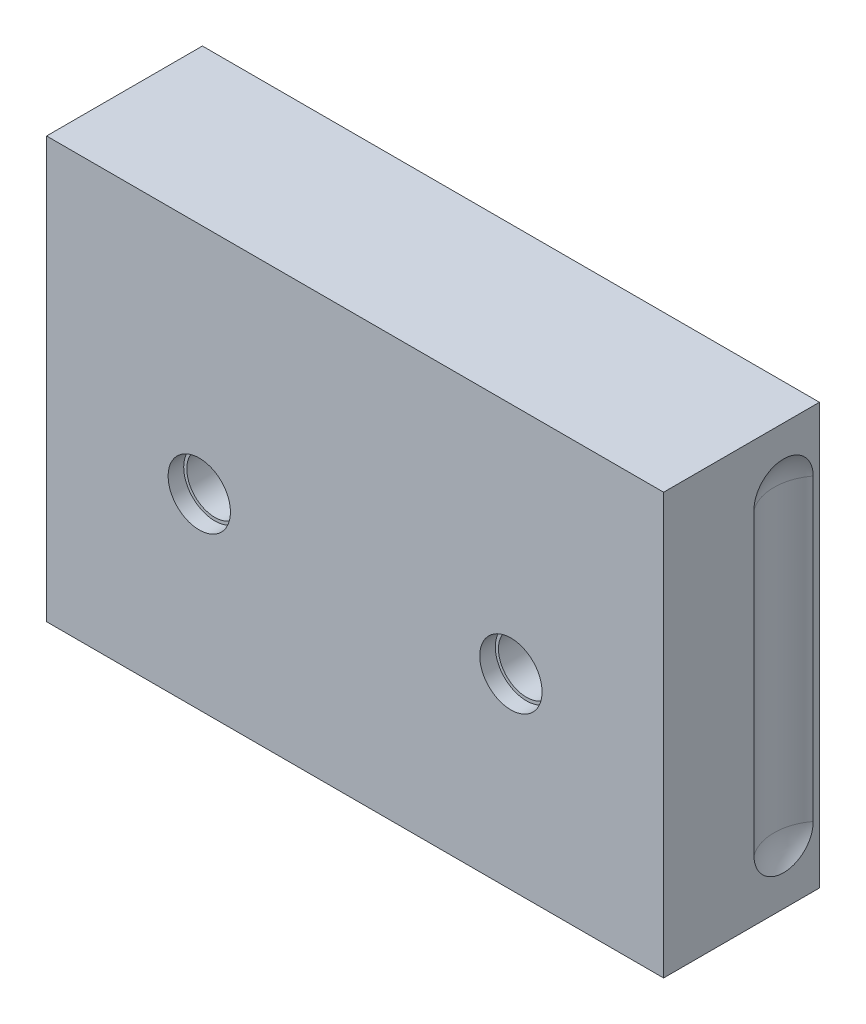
ISO-10303-21;
HEADER;
FILE_DESCRIPTION(('STEP AP214'),'2;1');
FILE_NAME('part.step','',(''),(''),'','','');
FILE_SCHEMA(('AUTOMOTIVE_DESIGN { 1 0 10303 214 1 1 1 1 }'));
ENDSEC;
DATA;
#1=APPLICATION_CONTEXT('core data for automotive mechanical design processes');
#2=APPLICATION_PROTOCOL_DEFINITION('international standard','automotive_design',2000,#1);
#3=PRODUCT_CONTEXT('',#1,'mechanical');
#4=PRODUCT('Part','Part','',(#3));
#5=PRODUCT_RELATED_PRODUCT_CATEGORY('part','',(#4));
#6=PRODUCT_DEFINITION_FORMATION('','',#4);
#7=PRODUCT_DEFINITION_CONTEXT('part definition',#1,'design');
#8=PRODUCT_DEFINITION('design','',#6,#7);
#9=PRODUCT_DEFINITION_SHAPE('','',#8);
#10=(LENGTH_UNIT() NAMED_UNIT(*) SI_UNIT(.MILLI.,.METRE.));
#11=(NAMED_UNIT(*) PLANE_ANGLE_UNIT() SI_UNIT($,.RADIAN.));
#12=(NAMED_UNIT(*) SI_UNIT($,.STERADIAN.) SOLID_ANGLE_UNIT());
#13=UNCERTAINTY_MEASURE_WITH_UNIT(LENGTH_MEASURE(1.E-05),#10,'distance_accuracy_value','');
#14=(GEOMETRIC_REPRESENTATION_CONTEXT(3) GLOBAL_UNCERTAINTY_ASSIGNED_CONTEXT((#13)) GLOBAL_UNIT_ASSIGNED_CONTEXT((#10,
#11,#12)) REPRESENTATION_CONTEXT('',''));
#15=CARTESIAN_POINT('',(0.,0.,0.));
#16=DIRECTION('',(0.,0.,1.));
#17=DIRECTION('',(1.,0.,0.));
#18=AXIS2_PLACEMENT_3D('',#15,#16,#17);
#19=CARTESIAN_POINT('',(-174.500411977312,100.799588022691,66.));
#20=DIRECTION('',(0.,0.,-1.));
#21=DIRECTION('',(-1.,0.,0.));
#22=AXIS2_PLACEMENT_3D('',#19,#20,#21);
#23=CYLINDRICAL_SURFACE('',#22,5.);
#24=CARTESIAN_POINT('',(-174.500411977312,100.799588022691,62.5));
#25=DIRECTION('',(0.,0.,-1.));
#26=DIRECTION('',(-1.,0.,0.));
#27=AXIS2_PLACEMENT_3D('',#24,#25,#26);
#28=CIRCLE('',#27,5.);
#29=CARTESIAN_POINT('',(-179.500411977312,100.799588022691,62.5));
#30=VERTEX_POINT('',#29);
#31=EDGE_CURVE('E348',#30,#30,#28,.F.);
#32=ORIENTED_EDGE('',*,*,#31,.F.);
#33=EDGE_LOOP('',(#32));
#34=FACE_BOUND('',#33,.T.);
#35=CARTESIAN_POINT('',(-174.500411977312,100.799588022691,84.5));
#36=DIRECTION('',(0.,0.,-1.));
#37=DIRECTION('',(-1.,0.,0.));
#38=AXIS2_PLACEMENT_3D('',#35,#36,#37);
#39=CIRCLE('',#38,5.);
#40=CARTESIAN_POINT('',(-179.500411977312,100.799588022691,84.5));
#41=VERTEX_POINT('',#40);
#42=EDGE_CURVE('E350',#41,#41,#39,.F.);
#43=ORIENTED_EDGE('',*,*,#42,.T.);
#44=EDGE_LOOP('',(#43));
#45=FACE_BOUND('',#44,.T.);
#46=ADVANCED_FACE('F14',(#34,#45),#23,.F.);
#47=CARTESIAN_POINT('',(-74.5004119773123,100.799588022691,66.));
#48=DIRECTION('',(0.,0.,-1.));
#49=DIRECTION('',(-1.,0.,0.));
#50=AXIS2_PLACEMENT_3D('',#47,#48,#49);
#51=CYLINDRICAL_SURFACE('',#50,5.);
#52=CARTESIAN_POINT('',(-74.5004119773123,100.799588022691,62.5));
#53=DIRECTION('',(0.,0.,-1.));
#54=DIRECTION('',(-1.,0.,0.));
#55=AXIS2_PLACEMENT_3D('',#52,#53,#54);
#56=CIRCLE('',#55,5.);
#57=CARTESIAN_POINT('',(-79.5004119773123,100.799588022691,62.5));
#58=VERTEX_POINT('',#57);
#59=EDGE_CURVE('E342',#58,#58,#56,.F.);
#60=ORIENTED_EDGE('',*,*,#59,.F.);
#61=EDGE_LOOP('',(#60));
#62=FACE_BOUND('',#61,.T.);
#63=CARTESIAN_POINT('',(-74.5004119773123,100.799588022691,84.5));
#64=DIRECTION('',(0.,0.,-1.));
#65=DIRECTION('',(-1.,0.,0.));
#66=AXIS2_PLACEMENT_3D('',#63,#64,#65);
#67=CIRCLE('',#66,5.);
#68=CARTESIAN_POINT('',(-79.5004119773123,100.799588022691,84.5));
#69=VERTEX_POINT('',#68);
#70=EDGE_CURVE('E18',#69,#69,#67,.F.);
#71=ORIENTED_EDGE('',*,*,#70,.T.);
#72=EDGE_LOOP('',(#71));
#73=FACE_BOUND('',#72,.T.);
#74=ADVANCED_FACE('F357',(#62,#73),#51,.F.);
#75=CARTESIAN_POINT('',(-74.5004119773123,100.799588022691,84.5));
#76=DIRECTION('',(0.,0.,-1.));
#77=DIRECTION('',(-1.,0.,0.));
#78=AXIS2_PLACEMENT_3D('',#75,#76,#77);
#79=PLANE('',#78);
#80=ORIENTED_EDGE('',*,*,#70,.F.);
#81=EDGE_LOOP('',(#80));
#82=FACE_BOUND('',#81,.T.);
#83=CARTESIAN_POINT('',(-74.5004119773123,100.799588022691,84.5));
#84=DIRECTION('',(0.,0.,-1.));
#85=DIRECTION('',(-1.,0.,0.));
#86=AXIS2_PLACEMENT_3D('',#83,#84,#85);
#87=CIRCLE('',#86,9.);
#88=CARTESIAN_POINT('',(-83.5004119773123,100.799588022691,84.5));
#89=VERTEX_POINT('',#88);
#90=EDGE_CURVE('E336',#89,#89,#87,.F.);
#91=ORIENTED_EDGE('',*,*,#90,.T.);
#92=EDGE_LOOP('',(#91));
#93=FACE_BOUND('',#92,.T.);
#94=ADVANCED_FACE('F359',(#82,#93),#79,.F.);
#95=CARTESIAN_POINT('',(-174.500411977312,100.799588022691,84.5));
#96=DIRECTION('',(0.,0.,-1.));
#97=DIRECTION('',(-1.,0.,0.));
#98=AXIS2_PLACEMENT_3D('',#95,#96,#97);
#99=PLANE('',#98);
#100=ORIENTED_EDGE('',*,*,#42,.F.);
#101=EDGE_LOOP('',(#100));
#102=FACE_BOUND('',#101,.T.);
#103=CARTESIAN_POINT('',(-174.500411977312,100.799588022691,84.5));
#104=DIRECTION('',(0.,0.,-1.));
#105=DIRECTION('',(-1.,0.,0.));
#106=AXIS2_PLACEMENT_3D('',#103,#104,#105);
#107=CIRCLE('',#106,9.);
#108=CARTESIAN_POINT('',(-183.500411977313,100.799588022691,84.5));
#109=VERTEX_POINT('',#108);
#110=EDGE_CURVE('E333',#109,#109,#107,.F.);
#111=ORIENTED_EDGE('',*,*,#110,.T.);
#112=EDGE_LOOP('',(#111));
#113=FACE_BOUND('',#112,.T.);
#114=ADVANCED_FACE('F362',(#102,#113),#99,.F.);
#115=CARTESIAN_POINT('',(-174.500411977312,100.799588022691,62.5));
#116=DIRECTION('',(0.,0.,-1.));
#117=DIRECTION('',(-1.,0.,0.));
#118=AXIS2_PLACEMENT_3D('',#115,#116,#117);
#119=PLANE('',#118);
#120=CARTESIAN_POINT('',(-174.500411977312,100.799588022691,62.5));
#121=DIRECTION('',(0.,0.,-1.));
#122=DIRECTION('',(-1.,0.,0.));
#123=AXIS2_PLACEMENT_3D('',#120,#121,#122);
#124=CIRCLE('',#123,9.);
#125=CARTESIAN_POINT('',(-183.500411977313,100.799588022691,62.5));
#126=VERTEX_POINT('',#125);
#127=EDGE_CURVE('E335',#126,#126,#124,.F.);
#128=ORIENTED_EDGE('',*,*,#127,.F.);
#129=EDGE_LOOP('',(#128));
#130=FACE_BOUND('',#129,.T.);
#131=ORIENTED_EDGE('',*,*,#31,.T.);
#132=EDGE_LOOP('',(#131));
#133=FACE_BOUND('',#132,.T.);
#134=ADVANCED_FACE('F401',(#130,#133),#119,.T.);
#135=CARTESIAN_POINT('',(-136.01541197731,78.7995880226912,83.));
#136=DIRECTION('',(0.,0.,-1.));
#137=DIRECTION('',(-1.,0.,0.));
#138=AXIS2_PLACEMENT_3D('',#135,#136,#137);
#139=TOROIDAL_SURFACE('',#138,9.00000000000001,2.5);
#140=CARTESIAN_POINT('',(-147.50041197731,78.7995880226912,83.2734501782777));
#141=CARTESIAN_POINT('',(-147.50041197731,78.8523853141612,83.2734552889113));
#142=CARTESIAN_POINT('',(-147.50041197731,78.90520941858,83.2701925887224));
#143=CARTESIAN_POINT('',(-147.50041197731,78.9836502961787,83.2600004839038));
#144=CARTESIAN_POINT('',(-147.50041197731,79.0096313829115,83.2557291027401));
#145=CARTESIAN_POINT('',(-147.50041197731,79.0612155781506,83.2452152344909));
#146=CARTESIAN_POINT('',(-147.50041197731,79.086818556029,83.2389720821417));
#147=CARTESIAN_POINT('',(-147.50041197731,79.1319268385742,83.2257832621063));
#148=CARTESIAN_POINT('',(-147.50041197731,79.1515600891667,83.2192769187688));
#149=CARTESIAN_POINT('',(-147.50041197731,79.1901876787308,83.204608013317));
#150=CARTESIAN_POINT('',(-147.50041197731,79.2091827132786,83.1964473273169));
#151=CARTESIAN_POINT('',(-147.50041197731,79.2463977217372,83.1779977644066));
#152=CARTESIAN_POINT('',(-147.50041197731,79.264606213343,83.1676854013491));
#153=CARTESIAN_POINT('',(-147.50041197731,79.2992587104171,83.1444367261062));
#154=CARTESIAN_POINT('',(-147.500411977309,79.3157105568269,83.1315128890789));
#155=CARTESIAN_POINT('',(-147.50041197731,79.3371665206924,83.1103383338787));
#156=CARTESIAN_POINT('',(-147.50041197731,79.3434882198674,83.1034297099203));
#157=CARTESIAN_POINT('',(-147.50041197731,79.3552200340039,83.0888561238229));
#158=CARTESIAN_POINT('',(-147.50041197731,79.3606295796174,83.0811906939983));
#159=CARTESIAN_POINT('',(-147.50041197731,79.3702638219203,83.0649921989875));
#160=CARTESIAN_POINT('',(-147.50041197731,79.3744718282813,83.056448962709));
#161=CARTESIAN_POINT('',(-147.50041197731,79.3811753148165,83.0387301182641));
#162=CARTESIAN_POINT('',(-147.50041197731,79.3836772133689,83.0295570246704));
#163=CARTESIAN_POINT('',(-147.50041197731,79.3864936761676,83.0118191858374));
#164=CARTESIAN_POINT('',(-147.50041197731,79.3870027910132,83.0032859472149));
#165=CARTESIAN_POINT('',(-147.50041197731,79.386311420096,82.9862928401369));
#166=CARTESIAN_POINT('',(-147.50041197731,79.3851107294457,82.9778329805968));
#167=CARTESIAN_POINT('',(-147.50041197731,79.379732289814,82.9554528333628));
#168=CARTESIAN_POINT('',(-147.50041197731,79.37405212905,82.9418895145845));
#169=CARTESIAN_POINT('',(-147.50041197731,79.3609320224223,82.9189771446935));
#170=CARTESIAN_POINT('',(-147.50041197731,79.354001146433,82.909310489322));
#171=CARTESIAN_POINT('',(-147.50041197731,79.338733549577,82.8911398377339));
#172=CARTESIAN_POINT('',(-147.50041197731,79.3303933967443,82.8826387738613));
#173=CARTESIAN_POINT('',(-147.50041197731,79.3060854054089,82.8606392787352));
#174=CARTESIAN_POINT('',(-147.50041197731,79.2891329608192,82.8482454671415));
#175=CARTESIAN_POINT('',(-147.50041197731,79.2536796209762,82.8259633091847));
#176=CARTESIAN_POINT('',(-147.50041197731,79.2351750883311,82.8160810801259));
#177=CARTESIAN_POINT('',(-147.50041197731,79.1971116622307,82.7982439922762));
#178=CARTESIAN_POINT('',(-147.50041197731,79.1775462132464,82.7903033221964));
#179=CARTESIAN_POINT('',(-147.50041197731,79.1378189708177,82.7760830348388));
#180=CARTESIAN_POINT('',(-147.50041197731,79.117656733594,82.7698046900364));
#181=CARTESIAN_POINT('',(-147.50041197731,79.0564970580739,82.753065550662));
#182=CARTESIAN_POINT('',(-147.50041197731,79.0149100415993,82.7447364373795));
#183=CARTESIAN_POINT('',(-147.50041197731,78.9387826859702,82.7338085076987));
#184=CARTESIAN_POINT('',(-147.50041197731,78.9043416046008,82.7304412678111));
#185=CARTESIAN_POINT('',(-147.50041197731,78.8352661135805,82.7265736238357));
#186=CARTESIAN_POINT('',(-147.50041197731,78.8006315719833,82.7260755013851));
#187=CARTESIAN_POINT('',(-147.50041197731,78.7314761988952,82.7279146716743));
#188=CARTESIAN_POINT('',(-147.50041197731,78.6969552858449,82.7302489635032));
#189=CARTESIAN_POINT('',(-147.50041197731,78.6282642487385,82.7379061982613));
#190=CARTESIAN_POINT('',(-147.50041197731,78.5940938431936,82.7432265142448));
#191=CARTESIAN_POINT('',(-147.50041197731,78.5276303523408,82.7570160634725));
#192=CARTESIAN_POINT('',(-147.500411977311,78.4953133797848,82.7653688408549));
#193=CARTESIAN_POINT('',(-147.500411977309,78.4319654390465,82.7859159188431));
#194=CARTESIAN_POINT('',(-147.500411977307,78.4009302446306,82.798096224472));
#195=CARTESIAN_POINT('',(-147.500411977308,78.3569240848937,82.8199636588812));
#196=CARTESIAN_POINT('',(-147.50041197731,78.3429612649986,82.8276467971));
#197=CARTESIAN_POINT('',(-147.50041197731,78.3159452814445,82.8444560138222));
#198=CARTESIAN_POINT('',(-147.50041197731,78.3028904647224,82.853579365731));
#199=CARTESIAN_POINT('',(-147.50041197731,78.2804496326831,82.871768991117));
#200=CARTESIAN_POINT('',(-147.50041197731,78.2708294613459,82.8805400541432));
#201=CARTESIAN_POINT('',(-147.50041197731,78.2530400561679,82.8994148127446));
#202=CARTESIAN_POINT('',(-147.50041197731,78.244866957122,82.9095148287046));
#203=CARTESIAN_POINT('',(-147.50041197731,78.228710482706,82.9343470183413));
#204=CARTESIAN_POINT('',(-147.50041197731,78.2214240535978,82.9495836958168));
#205=CARTESIAN_POINT('',(-147.50041197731,78.2148574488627,82.9737193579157));
#206=CARTESIAN_POINT('',(-147.50041197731,78.213400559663,82.9820332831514));
#207=CARTESIAN_POINT('',(-147.50041197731,78.21214518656,82.9987883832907));
#208=CARTESIAN_POINT('',(-147.50041197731,78.2123456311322,83.0072294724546));
#209=CARTESIAN_POINT('',(-147.50041197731,78.2142477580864,83.0228241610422));
#210=CARTESIAN_POINT('',(-147.50041197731,78.2157521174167,83.0300031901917));
#211=CARTESIAN_POINT('',(-147.50041197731,78.2198622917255,83.0440462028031));
#212=CARTESIAN_POINT('',(-147.50041197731,78.2224701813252,83.0509095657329));
#213=CARTESIAN_POINT('',(-147.50041197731,78.23432121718,83.0765965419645));
#214=CARTESIAN_POINT('',(-147.50041197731,78.2468761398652,83.0938883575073));
#215=CARTESIAN_POINT('',(-147.50041197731,78.2732469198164,83.1221499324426));
#216=CARTESIAN_POINT('',(-147.50041197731,78.2865264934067,83.1336903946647));
#217=CARTESIAN_POINT('',(-147.50041197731,78.3146322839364,83.1547882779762));
#218=CARTESIAN_POINT('',(-147.50041197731,78.3294627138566,83.1643400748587));
#219=CARTESIAN_POINT('',(-147.50041197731,78.3598439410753,83.1816683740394));
#220=CARTESIAN_POINT('',(-147.50041197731,78.3753829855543,83.1894661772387));
#221=CARTESIAN_POINT('',(-147.50041197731,78.4070643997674,83.2037344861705));
#222=CARTESIAN_POINT('',(-147.50041197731,78.423207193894,83.2102040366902));
#223=CARTESIAN_POINT('',(-147.50041197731,78.4722697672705,83.2279283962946));
#224=CARTESIAN_POINT('',(-147.50041197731,78.5058007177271,83.2374868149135));
#225=CARTESIAN_POINT('',(-147.50041197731,78.582260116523,83.2550274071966));
#226=CARTESIAN_POINT('',(-147.50041197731,78.6254122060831,83.2619925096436));
#227=CARTESIAN_POINT('',(-147.50041197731,78.7122324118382,83.271204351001));
#228=CARTESIAN_POINT('',(-147.50041197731,78.7559010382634,83.273445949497));
#229=CARTESIAN_POINT('',(-147.50041197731,78.7995880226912,83.2734501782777));
#230=B_SPLINE_CURVE_WITH_KNOTS('',3,(#140,#141,#142,#143,#144,#145,#146,#147,#148,#149,#150,
#151,#152,#153,#154,#155,#156,#157,#158,#159,#160,#161,#162,#163,#164,#165,#166,#167,#168,#169,
#170,#171,#172,#173,#174,#175,#176,#177,#178,#179,#180,#181,#182,#183,#184,#185,#186,#187,#188,
#189,#190,#191,#192,#193,#194,#195,#196,#197,#198,#199,#200,#201,#202,#203,#204,#205,#206,#207,
#208,#209,#210,#211,#212,#213,#214,#215,#216,#217,#218,#219,#220,#221,#222,#223,#224,#225,#226,
#227,#228,#229),.UNSPECIFIED.,.T.,.F.,(4,2,2,2,2,2,2,2,2,2,2,2,2,2,2,2,2,2,2,2,2,2,2,2,2,2,2,2,
2,2,2,2,2,2,2,2,2,2,2,2,2,2,2,2,4),(0.,0.158280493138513,0.237215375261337,0.31617691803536,
0.378168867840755,0.440090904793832,0.502727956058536,0.56507257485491,0.593109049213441,
0.621162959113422,0.649589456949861,0.67790841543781,0.703381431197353,0.72885749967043,
0.772301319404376,0.80783110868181,0.84344870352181,0.906101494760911,0.968905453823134,
1.03215550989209,1.09545384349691,1.22232014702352,1.326030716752,1.42982374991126,
1.53350691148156,1.6370990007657,1.73707341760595,1.83668645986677,1.88443333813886,
1.93209088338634,1.97102529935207,2.00985409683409,2.05957979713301,2.08475480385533,
2.10991353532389,2.13182148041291,2.15377079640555,2.2165997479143,2.269220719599,
2.32198854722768,2.3740760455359,2.426200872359,2.5305277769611,2.66135426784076,
2.79232305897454),.UNSPECIFIED.);
#231=CARTESIAN_POINT('',(-147.50041197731,78.7995880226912,83.2734501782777));
#232=VERTEX_POINT('',#231);
#233=EDGE_CURVE('E339',#232,#232,#230,.T.);
#234=ORIENTED_EDGE('',*,*,#233,.F.);
#235=EDGE_LOOP('',(#234));
#236=FACE_BOUND('',#235,.T.);
#237=ADVANCED_FACE('F395',(#236),#139,.F.);
#238=CARTESIAN_POINT('',(-136.01541197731,137.799588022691,83.));
#239=DIRECTION('',(0.,0.,-1.));
#240=DIRECTION('',(-1.,0.,0.));
#241=AXIS2_PLACEMENT_3D('',#238,#239,#240);
#242=TOROIDAL_SURFACE('',#241,9.00000000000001,2.5);
#243=CARTESIAN_POINT('',(-147.50041197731,137.799588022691,83.2734501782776));
#244=CARTESIAN_POINT('',(-147.50041197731,137.852385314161,83.2734552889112));
#245=CARTESIAN_POINT('',(-147.50041197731,137.90520941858,83.2701925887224));
#246=CARTESIAN_POINT('',(-147.50041197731,137.983650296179,83.260000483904));
#247=CARTESIAN_POINT('',(-147.50041197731,138.009631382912,83.2557291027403));
#248=CARTESIAN_POINT('',(-147.50041197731,138.061215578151,83.2452152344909));
#249=CARTESIAN_POINT('',(-147.50041197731,138.086818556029,83.2389720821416));
#250=CARTESIAN_POINT('',(-147.50041197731,138.131926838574,83.2257832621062));
#251=CARTESIAN_POINT('',(-147.50041197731,138.151560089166,83.2192769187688));
#252=CARTESIAN_POINT('',(-147.50041197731,138.19018767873,83.2046080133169));
#253=CARTESIAN_POINT('',(-147.50041197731,138.209182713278,83.1964473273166));
#254=CARTESIAN_POINT('',(-147.50041197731,138.246397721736,83.1779977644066));
#255=CARTESIAN_POINT('',(-147.50041197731,138.264606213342,83.1676854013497));
#256=CARTESIAN_POINT('',(-147.50041197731,138.299258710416,83.1444367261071));
#257=CARTESIAN_POINT('',(-147.500411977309,138.315710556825,83.1315128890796));
#258=CARTESIAN_POINT('',(-147.50041197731,138.337166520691,83.1103383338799));
#259=CARTESIAN_POINT('',(-147.50041197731,138.343488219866,83.1034297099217));
#260=CARTESIAN_POINT('',(-147.50041197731,138.355220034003,83.0888561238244));
#261=CARTESIAN_POINT('',(-147.50041197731,138.360629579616,83.0811906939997));
#262=CARTESIAN_POINT('',(-147.50041197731,138.370263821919,83.0649921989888));
#263=CARTESIAN_POINT('',(-147.50041197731,138.37447182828,83.0564489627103));
#264=CARTESIAN_POINT('',(-147.50041197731,138.381175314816,83.0387301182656));
#265=CARTESIAN_POINT('',(-147.50041197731,138.383677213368,83.029557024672));
#266=CARTESIAN_POINT('',(-147.50041197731,138.386493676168,83.011819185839));
#267=CARTESIAN_POINT('',(-147.50041197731,138.387002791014,83.0032859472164));
#268=CARTESIAN_POINT('',(-147.50041197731,138.386311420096,82.9862928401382));
#269=CARTESIAN_POINT('',(-147.50041197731,138.385110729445,82.977832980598));
#270=CARTESIAN_POINT('',(-147.50041197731,138.379732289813,82.9554528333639));
#271=CARTESIAN_POINT('',(-147.50041197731,138.37405212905,82.9418895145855));
#272=CARTESIAN_POINT('',(-147.50041197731,138.360932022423,82.9189771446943));
#273=CARTESIAN_POINT('',(-147.50041197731,138.354001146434,82.9093104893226));
#274=CARTESIAN_POINT('',(-147.50041197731,138.338733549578,82.8911398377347));
#275=CARTESIAN_POINT('',(-147.50041197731,138.330393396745,82.8826387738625));
#276=CARTESIAN_POINT('',(-147.50041197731,138.306085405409,82.8606392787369));
#277=CARTESIAN_POINT('',(-147.50041197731,138.28913296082,82.8482454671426));
#278=CARTESIAN_POINT('',(-147.50041197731,138.253679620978,82.8259633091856));
#279=CARTESIAN_POINT('',(-147.50041197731,138.235175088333,82.8160810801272));
#280=CARTESIAN_POINT('',(-147.50041197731,138.197111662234,82.7982439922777));
#281=CARTESIAN_POINT('',(-147.50041197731,138.17754621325,82.7903033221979));
#282=CARTESIAN_POINT('',(-147.50041197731,138.137818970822,82.7760830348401));
#283=CARTESIAN_POINT('',(-147.50041197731,138.117656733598,82.7698046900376));
#284=CARTESIAN_POINT('',(-147.50041197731,138.056497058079,82.753065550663));
#285=CARTESIAN_POINT('',(-147.50041197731,138.014910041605,82.7447364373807));
#286=CARTESIAN_POINT('',(-147.50041197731,137.938782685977,82.7338085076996));
#287=CARTESIAN_POINT('',(-147.50041197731,137.904341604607,82.7304412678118));
#288=CARTESIAN_POINT('',(-147.50041197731,137.835266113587,82.7265736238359));
#289=CARTESIAN_POINT('',(-147.50041197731,137.80063157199,82.726075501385));
#290=CARTESIAN_POINT('',(-147.50041197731,137.731476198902,82.7279146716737));
#291=CARTESIAN_POINT('',(-147.50041197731,137.696955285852,82.7302489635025));
#292=CARTESIAN_POINT('',(-147.50041197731,137.628264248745,82.7379061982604));
#293=CARTESIAN_POINT('',(-147.50041197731,137.594093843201,82.743226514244));
#294=CARTESIAN_POINT('',(-147.50041197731,137.527630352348,82.7570160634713));
#295=CARTESIAN_POINT('',(-147.500411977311,137.495313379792,82.7653688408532));
#296=CARTESIAN_POINT('',(-147.500411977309,137.431965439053,82.7859159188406));
#297=CARTESIAN_POINT('',(-147.500411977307,137.400930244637,82.7980962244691));
#298=CARTESIAN_POINT('',(-147.500411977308,137.356924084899,82.8199636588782));
#299=CARTESIAN_POINT('',(-147.50041197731,137.342961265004,82.8276467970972));
#300=CARTESIAN_POINT('',(-147.50041197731,137.315945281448,82.8444560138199));
#301=CARTESIAN_POINT('',(-147.50041197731,137.302890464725,82.853579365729));
#302=CARTESIAN_POINT('',(-147.50041197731,137.280449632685,82.8717689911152));
#303=CARTESIAN_POINT('',(-147.50041197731,137.270829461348,82.8805400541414));
#304=CARTESIAN_POINT('',(-147.50041197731,137.25304005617,82.8994148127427));
#305=CARTESIAN_POINT('',(-147.50041197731,137.244866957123,82.9095148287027));
#306=CARTESIAN_POINT('',(-147.50041197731,137.228710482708,82.9343470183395));
#307=CARTESIAN_POINT('',(-147.50041197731,137.2214240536,82.9495836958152));
#308=CARTESIAN_POINT('',(-147.50041197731,137.214857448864,82.9737193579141));
#309=CARTESIAN_POINT('',(-147.50041197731,137.213400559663,82.9820332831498));
#310=CARTESIAN_POINT('',(-147.50041197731,137.21214518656,82.9987883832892));
#311=CARTESIAN_POINT('',(-147.50041197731,137.212345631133,83.0072294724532));
#312=CARTESIAN_POINT('',(-147.50041197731,137.214247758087,83.022824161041));
#313=CARTESIAN_POINT('',(-147.50041197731,137.215752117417,83.0300031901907));
#314=CARTESIAN_POINT('',(-147.50041197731,137.219862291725,83.0440462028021));
#315=CARTESIAN_POINT('',(-147.50041197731,137.222470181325,83.0509095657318));
#316=CARTESIAN_POINT('',(-147.50041197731,137.23432121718,83.0765965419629));
#317=CARTESIAN_POINT('',(-147.50041197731,137.246876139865,83.0938883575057));
#318=CARTESIAN_POINT('',(-147.50041197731,137.273246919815,83.1221499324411));
#319=CARTESIAN_POINT('',(-147.50041197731,137.286526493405,83.1336903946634));
#320=CARTESIAN_POINT('',(-147.50041197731,137.314632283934,83.1547882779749));
#321=CARTESIAN_POINT('',(-147.50041197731,137.329462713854,83.1643400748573));
#322=CARTESIAN_POINT('',(-147.50041197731,137.359843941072,83.1816683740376));
#323=CARTESIAN_POINT('',(-147.50041197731,137.375382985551,83.1894661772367));
#324=CARTESIAN_POINT('',(-147.50041197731,137.407064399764,83.2037344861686));
#325=CARTESIAN_POINT('',(-147.50041197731,137.42320719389,83.2102040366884));
#326=CARTESIAN_POINT('',(-147.50041197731,137.472269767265,83.2279283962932));
#327=CARTESIAN_POINT('',(-147.50041197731,137.505800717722,83.2374868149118));
#328=CARTESIAN_POINT('',(-147.50041197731,137.582260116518,83.2550274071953));
#329=CARTESIAN_POINT('',(-147.50041197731,137.625412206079,83.2619925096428));
#330=CARTESIAN_POINT('',(-147.50041197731,137.712232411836,83.2712043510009));
#331=CARTESIAN_POINT('',(-147.50041197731,137.755901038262,83.2734459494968));
#332=CARTESIAN_POINT('',(-147.50041197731,137.799588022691,83.2734501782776));
#333=B_SPLINE_CURVE_WITH_KNOTS('',3,(#243,#244,#245,#246,#247,#248,#249,#250,#251,#252,#253,
#254,#255,#256,#257,#258,#259,#260,#261,#262,#263,#264,#265,#266,#267,#268,#269,#270,#271,#272,
#273,#274,#275,#276,#277,#278,#279,#280,#281,#282,#283,#284,#285,#286,#287,#288,#289,#290,#291,
#292,#293,#294,#295,#296,#297,#298,#299,#300,#301,#302,#303,#304,#305,#306,#307,#308,#309,#310,
#311,#312,#313,#314,#315,#316,#317,#318,#319,#320,#321,#322,#323,#324,#325,#326,#327,#328,#329,
#330,#331,#332),.UNSPECIFIED.,.T.,.F.,(4,2,2,2,2,2,2,2,2,2,2,2,2,2,2,2,2,2,2,2,2,2,2,2,2,2,2,2,
2,2,2,2,2,2,2,2,2,2,2,2,2,2,2,2,4),(0.,0.15828049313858,0.237215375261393,0.316176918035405,
0.378168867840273,0.440090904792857,0.502727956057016,0.565072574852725,0.593109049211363,
0.621162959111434,0.649589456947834,0.677908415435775,0.703381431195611,0.728857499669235,
0.772301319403,0.807831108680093,0.843448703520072,0.906101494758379,0.968905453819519,
1.03215550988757,1.09545384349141,1.22232014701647,1.32603071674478,1.42982374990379,
1.53350691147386,1.63709900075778,1.73707341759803,1.83668645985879,1.884433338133,
1.93209088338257,1.97102529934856,2.00985409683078,2.05957979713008,2.08475480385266,
2.10991353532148,2.13182148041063,2.15377079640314,2.21659974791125,2.26922071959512,
2.32198854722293,2.37407604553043,2.42620087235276,2.53052777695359,2.66135426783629,
2.79232305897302),.UNSPECIFIED.);
#334=CARTESIAN_POINT('',(-147.50041197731,137.799588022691,83.2734501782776));
#335=VERTEX_POINT('',#334);
#336=EDGE_CURVE('E385',#335,#335,#333,.T.);
#337=ORIENTED_EDGE('',*,*,#336,.F.);
#338=EDGE_LOOP('',(#337));
#339=FACE_BOUND('',#338,.T.);
#340=ADVANCED_FACE('F400',(#339),#242,.F.);
#341=CARTESIAN_POINT('',(-112.98541197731,78.7995880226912,83.));
#342=DIRECTION('',(0.,0.,-1.));
#343=DIRECTION('',(-1.,0.,0.));
#344=AXIS2_PLACEMENT_3D('',#341,#342,#343);
#345=TOROIDAL_SURFACE('',#344,8.99999999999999,2.5);
#346=CARTESIAN_POINT('',(-101.50041197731,78.7995880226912,83.2734501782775));
#347=CARTESIAN_POINT('',(-101.50041197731,78.7467907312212,83.2734552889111));
#348=CARTESIAN_POINT('',(-101.50041197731,78.6939666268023,83.2701925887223));
#349=CARTESIAN_POINT('',(-101.50041197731,78.6155257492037,83.2600004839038));
#350=CARTESIAN_POINT('',(-101.50041197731,78.5895446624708,83.2557291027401));
#351=CARTESIAN_POINT('',(-101.50041197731,78.5379604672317,83.2452152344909));
#352=CARTESIAN_POINT('',(-101.50041197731,78.5123574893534,83.2389720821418));
#353=CARTESIAN_POINT('',(-101.50041197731,78.4672492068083,83.2257832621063));
#354=CARTESIAN_POINT('',(-101.50041197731,78.447615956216,83.2192769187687));
#355=CARTESIAN_POINT('',(-101.50041197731,78.4089883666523,83.2046080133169));
#356=CARTESIAN_POINT('',(-101.50041197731,78.3899933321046,83.1964473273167));
#357=CARTESIAN_POINT('',(-101.50041197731,78.3527783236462,83.1779977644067));
#358=CARTESIAN_POINT('',(-101.50041197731,78.3345698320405,83.1676854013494));
#359=CARTESIAN_POINT('',(-101.50041197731,78.2999173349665,83.1444367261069));
#360=CARTESIAN_POINT('',(-101.50041197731,78.2834654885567,83.1315128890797));
#361=CARTESIAN_POINT('',(-101.50041197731,78.2620095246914,83.1103383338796));
#362=CARTESIAN_POINT('',(-101.50041197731,78.2556878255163,83.1034297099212));
#363=CARTESIAN_POINT('',(-101.50041197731,78.2439560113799,83.0888561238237));
#364=CARTESIAN_POINT('',(-101.50041197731,78.2385464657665,83.081190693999));
#365=CARTESIAN_POINT('',(-101.50041197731,78.2289122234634,83.0649921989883));
#366=CARTESIAN_POINT('',(-101.50041197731,78.2247042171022,83.0564489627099));
#367=CARTESIAN_POINT('',(-101.50041197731,78.2180007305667,83.0387301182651));
#368=CARTESIAN_POINT('',(-101.50041197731,78.2154988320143,83.0295570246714));
#369=CARTESIAN_POINT('',(-101.50041197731,78.2126823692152,83.0118191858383));
#370=CARTESIAN_POINT('',(-101.50041197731,78.2121732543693,83.0032859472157));
#371=CARTESIAN_POINT('',(-101.50041197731,78.2128646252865,82.9862928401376));
#372=CARTESIAN_POINT('',(-101.50041197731,78.2140653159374,82.9778329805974));
#373=CARTESIAN_POINT('',(-101.50041197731,78.2194437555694,82.9554528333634));
#374=CARTESIAN_POINT('',(-101.50041197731,78.2251239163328,82.9418895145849));
#375=CARTESIAN_POINT('',(-101.50041197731,78.23824402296,82.9189771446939));
#376=CARTESIAN_POINT('',(-101.50041197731,78.2451748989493,82.9093104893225));
#377=CARTESIAN_POINT('',(-101.50041197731,78.2604424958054,82.8911398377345));
#378=CARTESIAN_POINT('',(-101.50041197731,78.2687826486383,82.8826387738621));
#379=CARTESIAN_POINT('',(-101.50041197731,78.2930906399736,82.8606392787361));
#380=CARTESIAN_POINT('',(-101.50041197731,78.3100430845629,82.848245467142));
#381=CARTESIAN_POINT('',(-101.50041197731,78.3454964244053,82.825963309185));
#382=CARTESIAN_POINT('',(-101.50041197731,78.3640009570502,82.8160810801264));
#383=CARTESIAN_POINT('',(-101.50041197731,78.4020643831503,82.7982439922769));
#384=CARTESIAN_POINT('',(-101.50041197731,78.4216298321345,82.7903033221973));
#385=CARTESIAN_POINT('',(-101.50041197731,78.4613570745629,82.7760830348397));
#386=CARTESIAN_POINT('',(-101.50041197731,78.4815193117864,82.7698046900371));
#387=CARTESIAN_POINT('',(-101.50041197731,78.542678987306,82.7530655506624));
#388=CARTESIAN_POINT('',(-101.50041197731,78.5842660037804,82.7447364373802));
#389=CARTESIAN_POINT('',(-101.50041197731,78.6603933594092,82.7338085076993));
#390=CARTESIAN_POINT('',(-101.50041197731,78.6948344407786,82.7304412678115));
#391=CARTESIAN_POINT('',(-101.50041197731,78.7639099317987,82.7265736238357));
#392=CARTESIAN_POINT('',(-101.50041197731,78.7985444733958,82.7260755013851));
#393=CARTESIAN_POINT('',(-101.50041197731,78.8676998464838,82.7279146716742));
#394=CARTESIAN_POINT('',(-101.50041197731,78.902220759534,82.7302489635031));
#395=CARTESIAN_POINT('',(-101.50041197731,78.9709117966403,82.7379061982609));
#396=CARTESIAN_POINT('',(-101.50041197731,79.005082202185,82.7432265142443));
#397=CARTESIAN_POINT('',(-101.50041197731,79.0715456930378,82.7570160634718));
#398=CARTESIAN_POINT('',(-101.500411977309,79.1038626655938,82.7653688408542));
#399=CARTESIAN_POINT('',(-101.500411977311,79.1672106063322,82.785915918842));
#400=CARTESIAN_POINT('',(-101.500411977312,79.1982458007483,82.7980962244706));
#401=CARTESIAN_POINT('',(-101.500411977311,79.2422519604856,82.8199636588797));
#402=CARTESIAN_POINT('',(-101.50041197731,79.2562147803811,82.8276467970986));
#403=CARTESIAN_POINT('',(-101.50041197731,79.2832307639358,82.8444560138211));
#404=CARTESIAN_POINT('',(-101.50041197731,79.2962855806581,82.8535793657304));
#405=CARTESIAN_POINT('',(-101.50041197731,79.3187264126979,82.8717689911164));
#406=CARTESIAN_POINT('',(-101.50041197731,79.3283465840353,82.8805400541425));
#407=CARTESIAN_POINT('',(-101.50041197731,79.3461359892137,82.8994148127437));
#408=CARTESIAN_POINT('',(-101.50041197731,79.3543090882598,82.9095148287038));
#409=CARTESIAN_POINT('',(-101.50041197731,79.3704655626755,82.9343470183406));
#410=CARTESIAN_POINT('',(-101.50041197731,79.3777519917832,82.9495836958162));
#411=CARTESIAN_POINT('',(-101.50041197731,79.3843185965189,82.9737193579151));
#412=CARTESIAN_POINT('',(-101.50041197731,79.3857754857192,82.9820332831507));
#413=CARTESIAN_POINT('',(-101.50041197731,79.3870308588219,82.99878838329));
#414=CARTESIAN_POINT('',(-101.50041197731,79.3868304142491,83.007229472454));
#415=CARTESIAN_POINT('',(-101.50041197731,79.384928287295,83.0228241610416));
#416=CARTESIAN_POINT('',(-101.50041197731,79.3834239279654,83.0300031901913));
#417=CARTESIAN_POINT('',(-101.50041197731,79.379313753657,83.0440462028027));
#418=CARTESIAN_POINT('',(-101.50041197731,79.3767058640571,83.0509095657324));
#419=CARTESIAN_POINT('',(-101.50041197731,79.364854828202,83.0765965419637));
#420=CARTESIAN_POINT('',(-101.50041197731,79.3522999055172,83.0938883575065));
#421=CARTESIAN_POINT('',(-101.50041197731,79.3259291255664,83.1221499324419));
#422=CARTESIAN_POINT('',(-101.50041197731,79.3126495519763,83.1336903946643));
#423=CARTESIAN_POINT('',(-101.50041197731,79.2845437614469,83.1547882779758));
#424=CARTESIAN_POINT('',(-101.50041197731,79.2697133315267,83.1643400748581));
#425=CARTESIAN_POINT('',(-101.50041197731,79.2393321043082,83.1816683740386));
#426=CARTESIAN_POINT('',(-101.50041197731,79.2237930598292,83.1894661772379));
#427=CARTESIAN_POINT('',(-101.50041197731,79.1921116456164,83.2037344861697));
#428=CARTESIAN_POINT('',(-101.50041197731,79.17596885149,83.2102040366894));
#429=CARTESIAN_POINT('',(-101.50041197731,79.1269062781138,83.2279283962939));
#430=CARTESIAN_POINT('',(-101.50041197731,79.0933753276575,83.2374868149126));
#431=CARTESIAN_POINT('',(-101.50041197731,79.0169159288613,83.2550274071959));
#432=CARTESIAN_POINT('',(-101.50041197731,78.9737638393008,83.2619925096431));
#433=CARTESIAN_POINT('',(-101.50041197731,78.886943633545,83.2712043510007));
#434=CARTESIAN_POINT('',(-101.50041197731,78.8432750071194,83.2734459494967));
#435=CARTESIAN_POINT('',(-101.50041197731,78.7995880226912,83.2734501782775));
#436=B_SPLINE_CURVE_WITH_KNOTS('',3,(#346,#347,#348,#349,#350,#351,#352,#353,#354,#355,#356,
#357,#358,#359,#360,#361,#362,#363,#364,#365,#366,#367,#368,#369,#370,#371,#372,#373,#374,#375,
#376,#377,#378,#379,#380,#381,#382,#383,#384,#385,#386,#387,#388,#389,#390,#391,#392,#393,#394,
#395,#396,#397,#398,#399,#400,#401,#402,#403,#404,#405,#406,#407,#408,#409,#410,#411,#412,#413,
#414,#415,#416,#417,#418,#419,#420,#421,#422,#423,#424,#425,#426,#427,#428,#429,#430,#431,#432,
#433,#434,#435),.UNSPECIFIED.,.T.,.F.,(4,2,2,2,2,2,2,2,2,2,2,2,2,2,2,2,2,2,2,2,2,2,2,2,2,2,2,2,
2,2,2,2,2,2,2,2,2,2,2,2,2,2,2,2,4),(0.,0.158280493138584,0.237215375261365,0.316176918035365,
0.378168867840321,0.440090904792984,0.502727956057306,0.565072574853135,0.593109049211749,
0.621162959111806,0.64958945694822,0.677908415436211,0.703381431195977,0.728857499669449,
0.772301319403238,0.807831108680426,0.843448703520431,0.906101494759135,0.96890545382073,
1.03215550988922,1.09545384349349,1.22232014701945,1.32603071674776,1.4298237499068,
1.53350691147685,1.63709900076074,1.73707341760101,1.83668645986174,1.88443333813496,
1.9320908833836,1.97102529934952,2.00985409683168,2.05957979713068,2.08475480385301,
2.10991353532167,2.13182148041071,2.15377079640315,2.21659974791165,2.2692207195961,
2.32198854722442,2.37407604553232,2.42620087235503,2.53052777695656,2.66135426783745,
2.79232305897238),.UNSPECIFIED.);
#437=CARTESIAN_POINT('',(-101.50041197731,78.7995880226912,83.2734501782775));
#438=VERTEX_POINT('',#437);
#439=EDGE_CURVE('E286',#438,#438,#436,.T.);
#440=ORIENTED_EDGE('',*,*,#439,.F.);
#441=EDGE_LOOP('',(#440));
#442=FACE_BOUND('',#441,.T.);
#443=ADVANCED_FACE('F412',(#442),#345,.F.);
#444=CARTESIAN_POINT('',(-112.98541197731,137.799588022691,83.));
#445=DIRECTION('',(0.,0.,-1.));
#446=DIRECTION('',(-1.,0.,0.));
#447=AXIS2_PLACEMENT_3D('',#444,#445,#446);
#448=TOROIDAL_SURFACE('',#447,8.99999999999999,2.5);
#449=CARTESIAN_POINT('',(-101.50041197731,137.799588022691,83.2734501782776));
#450=CARTESIAN_POINT('',(-101.50041197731,137.746790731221,83.2734552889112));
#451=CARTESIAN_POINT('',(-101.50041197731,137.693966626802,83.2701925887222));
#452=CARTESIAN_POINT('',(-101.50041197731,137.615525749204,83.2600004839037));
#453=CARTESIAN_POINT('',(-101.50041197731,137.589544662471,83.2557291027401));
#454=CARTESIAN_POINT('',(-101.50041197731,137.537960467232,83.245215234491));
#455=CARTESIAN_POINT('',(-101.50041197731,137.512357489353,83.2389720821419));
#456=CARTESIAN_POINT('',(-101.50041197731,137.467249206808,83.2257832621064));
#457=CARTESIAN_POINT('',(-101.50041197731,137.447615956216,83.2192769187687));
#458=CARTESIAN_POINT('',(-101.50041197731,137.408988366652,83.2046080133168));
#459=CARTESIAN_POINT('',(-101.50041197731,137.389993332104,83.1964473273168));
#460=CARTESIAN_POINT('',(-101.50041197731,137.352778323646,83.1779977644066));
#461=CARTESIAN_POINT('',(-101.50041197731,137.33456983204,83.1676854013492));
#462=CARTESIAN_POINT('',(-101.50041197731,137.299917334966,83.1444367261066));
#463=CARTESIAN_POINT('',(-101.50041197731,137.283465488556,83.1315128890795));
#464=CARTESIAN_POINT('',(-101.50041197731,137.262009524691,83.1103383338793));
#465=CARTESIAN_POINT('',(-101.50041197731,137.255687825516,83.1034297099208));
#466=CARTESIAN_POINT('',(-101.50041197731,137.24395601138,83.0888561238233));
#467=CARTESIAN_POINT('',(-101.50041197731,137.238546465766,83.0811906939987));
#468=CARTESIAN_POINT('',(-101.50041197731,137.228912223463,83.064992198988));
#469=CARTESIAN_POINT('',(-101.50041197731,137.224704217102,83.0564489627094));
#470=CARTESIAN_POINT('',(-101.50041197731,137.218000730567,83.0387301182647));
#471=CARTESIAN_POINT('',(-101.50041197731,137.215498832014,83.0295570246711));
#472=CARTESIAN_POINT('',(-101.50041197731,137.212682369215,83.0118191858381));
#473=CARTESIAN_POINT('',(-101.50041197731,137.212173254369,83.0032859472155));
#474=CARTESIAN_POINT('',(-101.50041197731,137.212864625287,82.9862928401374));
#475=CARTESIAN_POINT('',(-101.50041197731,137.214065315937,82.9778329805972));
#476=CARTESIAN_POINT('',(-101.50041197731,137.219443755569,82.9554528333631));
#477=CARTESIAN_POINT('',(-101.50041197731,137.225123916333,82.9418895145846));
#478=CARTESIAN_POINT('',(-101.50041197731,137.23824402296,82.9189771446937));
#479=CARTESIAN_POINT('',(-101.50041197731,137.245174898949,82.9093104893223));
#480=CARTESIAN_POINT('',(-101.50041197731,137.260442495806,82.8911398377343));
#481=CARTESIAN_POINT('',(-101.50041197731,137.268782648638,82.8826387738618));
#482=CARTESIAN_POINT('',(-101.50041197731,137.293090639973,82.8606392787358));
#483=CARTESIAN_POINT('',(-101.50041197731,137.310043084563,82.8482454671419));
#484=CARTESIAN_POINT('',(-101.50041197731,137.345496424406,82.8259633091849));
#485=CARTESIAN_POINT('',(-101.50041197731,137.364000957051,82.8160810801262));
#486=CARTESIAN_POINT('',(-101.50041197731,137.402064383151,82.7982439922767));
#487=CARTESIAN_POINT('',(-101.50041197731,137.421629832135,82.7903033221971));
#488=CARTESIAN_POINT('',(-101.50041197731,137.461357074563,82.7760830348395));
#489=CARTESIAN_POINT('',(-101.50041197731,137.481519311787,82.7698046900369));
#490=CARTESIAN_POINT('',(-101.50041197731,137.542678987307,82.7530655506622));
#491=CARTESIAN_POINT('',(-101.50041197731,137.584266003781,82.7447364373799));
#492=CARTESIAN_POINT('',(-101.50041197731,137.66039335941,82.7338085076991));
#493=CARTESIAN_POINT('',(-101.50041197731,137.69483444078,82.7304412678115));
#494=CARTESIAN_POINT('',(-101.50041197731,137.7639099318,82.7265736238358));
#495=CARTESIAN_POINT('',(-101.50041197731,137.798544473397,82.7260755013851));
#496=CARTESIAN_POINT('',(-101.50041197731,137.867699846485,82.7279146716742));
#497=CARTESIAN_POINT('',(-101.50041197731,137.902220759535,82.7302489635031));
#498=CARTESIAN_POINT('',(-101.50041197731,137.970911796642,82.737906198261));
#499=CARTESIAN_POINT('',(-101.50041197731,138.005082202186,82.7432265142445));
#500=CARTESIAN_POINT('',(-101.50041197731,138.071545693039,82.7570160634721));
#501=CARTESIAN_POINT('',(-101.500411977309,138.103862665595,82.7653688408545));
#502=CARTESIAN_POINT('',(-101.500411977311,138.167210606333,82.7859159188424));
#503=CARTESIAN_POINT('',(-101.500411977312,138.198245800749,82.7980962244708));
#504=CARTESIAN_POINT('',(-101.500411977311,138.242251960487,82.81996365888));
#505=CARTESIAN_POINT('',(-101.50041197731,138.256214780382,82.8276467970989));
#506=CARTESIAN_POINT('',(-101.50041197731,138.283230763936,82.8444560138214));
#507=CARTESIAN_POINT('',(-101.50041197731,138.296285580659,82.8535793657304));
#508=CARTESIAN_POINT('',(-101.50041197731,138.318726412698,82.8717689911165));
#509=CARTESIAN_POINT('',(-101.50041197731,138.328346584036,82.8805400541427));
#510=CARTESIAN_POINT('',(-101.50041197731,138.346135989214,82.8994148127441));
#511=CARTESIAN_POINT('',(-101.50041197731,138.35430908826,82.9095148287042));
#512=CARTESIAN_POINT('',(-101.50041197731,138.370465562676,82.934347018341));
#513=CARTESIAN_POINT('',(-101.50041197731,138.377751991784,82.9495836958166));
#514=CARTESIAN_POINT('',(-101.50041197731,138.384318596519,82.9737193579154));
#515=CARTESIAN_POINT('',(-101.50041197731,138.385775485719,82.982033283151));
#516=CARTESIAN_POINT('',(-101.50041197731,138.387030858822,82.9987883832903));
#517=CARTESIAN_POINT('',(-101.50041197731,138.386830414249,83.0072294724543));
#518=CARTESIAN_POINT('',(-101.50041197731,138.384928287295,83.0228241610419));
#519=CARTESIAN_POINT('',(-101.50041197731,138.383423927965,83.0300031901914));
#520=CARTESIAN_POINT('',(-101.50041197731,138.379313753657,83.0440462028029));
#521=CARTESIAN_POINT('',(-101.50041197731,138.376705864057,83.0509095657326));
#522=CARTESIAN_POINT('',(-101.50041197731,138.364854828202,83.0765965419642));
#523=CARTESIAN_POINT('',(-101.50041197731,138.352299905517,83.0938883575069));
#524=CARTESIAN_POINT('',(-101.50041197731,138.325929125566,83.1221499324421));
#525=CARTESIAN_POINT('',(-101.50041197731,138.312649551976,83.1336903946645));
#526=CARTESIAN_POINT('',(-101.50041197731,138.284543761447,83.1547882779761));
#527=CARTESIAN_POINT('',(-101.50041197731,138.269713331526,83.1643400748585));
#528=CARTESIAN_POINT('',(-101.50041197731,138.239332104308,83.181668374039));
#529=CARTESIAN_POINT('',(-101.50041197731,138.223793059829,83.1894661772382));
#530=CARTESIAN_POINT('',(-101.50041197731,138.192111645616,83.2037344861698));
#531=CARTESIAN_POINT('',(-101.50041197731,138.175968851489,83.2102040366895));
#532=CARTESIAN_POINT('',(-101.50041197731,138.126906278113,83.2279283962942));
#533=CARTESIAN_POINT('',(-101.50041197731,138.093375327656,83.2374868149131));
#534=CARTESIAN_POINT('',(-101.50041197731,138.01691592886,83.2550274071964));
#535=CARTESIAN_POINT('',(-101.50041197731,137.9737638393,83.2619925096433));
#536=CARTESIAN_POINT('',(-101.50041197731,137.886943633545,83.2712043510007));
#537=CARTESIAN_POINT('',(-101.50041197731,137.843275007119,83.2734459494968));
#538=CARTESIAN_POINT('',(-101.50041197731,137.799588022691,83.2734501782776));
#539=B_SPLINE_CURVE_WITH_KNOTS('',3,(#449,#450,#451,#452,#453,#454,#455,#456,#457,#458,#459,
#460,#461,#462,#463,#464,#465,#466,#467,#468,#469,#470,#471,#472,#473,#474,#475,#476,#477,#478,
#479,#480,#481,#482,#483,#484,#485,#486,#487,#488,#489,#490,#491,#492,#493,#494,#495,#496,#497,
#498,#499,#500,#501,#502,#503,#504,#505,#506,#507,#508,#509,#510,#511,#512,#513,#514,#515,#516,
#517,#518,#519,#520,#521,#522,#523,#524,#525,#526,#527,#528,#529,#530,#531,#532,#533,#534,#535,
#536,#537,#538),.UNSPECIFIED.,.T.,.F.,(4,2,2,2,2,2,2,2,2,2,2,2,2,2,2,2,2,2,2,2,2,2,2,2,2,2,2,2,
2,2,2,2,2,2,2,2,2,2,2,2,2,2,2,2,4),(0.,0.158280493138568,0.237215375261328,0.316176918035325,
0.378168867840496,0.440090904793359,0.502727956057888,0.565072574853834,0.593109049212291,
0.62116295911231,0.649589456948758,0.677908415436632,0.703381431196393,0.72885749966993,
0.772301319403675,0.807831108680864,0.843448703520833,0.906101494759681,0.968905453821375,
1.03215550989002,1.09545384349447,1.22232014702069,1.32603071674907,1.42982374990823,
1.53350691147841,1.63709900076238,1.73707341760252,1.83668645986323,1.88443333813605,
1.93209088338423,1.97102529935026,2.00985409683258,2.05957979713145,2.08475480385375,
2.10991353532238,2.13182148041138,2.15377079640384,2.21659974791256,2.269220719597,
2.32198854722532,2.37407604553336,2.42620087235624,2.53052777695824,2.66135426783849,
2.79232305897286),.UNSPECIFIED.);
#540=CARTESIAN_POINT('',(-101.50041197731,137.799588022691,83.2734501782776));
#541=VERTEX_POINT('',#540);
#542=EDGE_CURVE('E277',#541,#541,#539,.T.);
#543=ORIENTED_EDGE('',*,*,#542,.F.);
#544=EDGE_LOOP('',(#543));
#545=FACE_BOUND('',#544,.T.);
#546=ADVANCED_FACE('F292',(#545),#448,.F.);
#547=CARTESIAN_POINT('',(-124.50041197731,108.299588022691,85.5));
#548=DIRECTION('',(0.,0.,-1.));
#549=DIRECTION('',(-1.,0.,0.));
#550=AXIS2_PLACEMENT_3D('',#547,#548,#549);
#551=PLANE('',#550);
#552=DIRECTION('',(0.,1.,0.));
#553=VECTOR('',#552,1.);
#554=CARTESIAN_POINT('',(-147.50041197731,108.299588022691,85.5));
#555=LINE('',#554,#553);
#556=CARTESIAN_POINT('',(-147.50041197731,155.299588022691,85.5));
#557=VERTEX_POINT('',#556);
#558=CARTESIAN_POINT('',(-147.50041197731,61.2995880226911,85.5));
#559=VERTEX_POINT('',#558);
#560=EDGE_CURVE('E435',#557,#559,#555,.F.);
#561=ORIENTED_EDGE('',*,*,#560,.F.);
#562=DIRECTION('',(1.,0.,0.));
#563=VECTOR('',#562,1.);
#564=CARTESIAN_POINT('',(-124.50041197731,155.299588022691,85.5));
#565=LINE('',#564,#563);
#566=CARTESIAN_POINT('',(-101.50041197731,155.299588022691,85.5));
#567=VERTEX_POINT('',#566);
#568=EDGE_CURVE('E428',#567,#557,#565,.F.);
#569=ORIENTED_EDGE('',*,*,#568,.F.);
#570=DIRECTION('',(0.,1.,0.));
#571=VECTOR('',#570,1.);
#572=CARTESIAN_POINT('',(-101.50041197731,108.299588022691,85.5));
#573=LINE('',#572,#571);
#574=CARTESIAN_POINT('',(-101.50041197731,61.2995880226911,85.5));
#575=VERTEX_POINT('',#574);
#576=EDGE_CURVE('E285',#575,#567,#573,.T.);
#577=ORIENTED_EDGE('',*,*,#576,.F.);
#578=DIRECTION('',(1.,0.,0.));
#579=VECTOR('',#578,1.);
#580=CARTESIAN_POINT('',(-124.50041197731,61.2995880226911,85.5));
#581=LINE('',#580,#579);
#582=EDGE_CURVE('E444',#559,#575,#581,.T.);
#583=ORIENTED_EDGE('',*,*,#582,.F.);
#584=EDGE_LOOP('',(#561,#569,#577,#583));
#585=FACE_BOUND('',#584,.T.);
#586=ADVANCED_FACE('F374',(#585),#551,.T.);
#587=CARTESIAN_POINT('',(-74.5004119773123,100.799588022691,62.5));
#588=DIRECTION('',(0.,0.,-1.));
#589=DIRECTION('',(-1.,0.,0.));
#590=AXIS2_PLACEMENT_3D('',#587,#588,#589);
#591=PLANE('',#590);
#592=CARTESIAN_POINT('',(-74.5004119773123,100.799588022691,62.5));
#593=DIRECTION('',(0.,0.,-1.));
#594=DIRECTION('',(-1.,0.,0.));
#595=AXIS2_PLACEMENT_3D('',#592,#593,#594);
#596=CIRCLE('',#595,9.);
#597=CARTESIAN_POINT('',(-83.5004119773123,100.799588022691,62.5));
#598=VERTEX_POINT('',#597);
#599=EDGE_CURVE('E273',#598,#598,#596,.F.);
#600=ORIENTED_EDGE('',*,*,#599,.F.);
#601=EDGE_LOOP('',(#600));
#602=FACE_BOUND('',#601,.T.);
#603=ORIENTED_EDGE('',*,*,#59,.T.);
#604=EDGE_LOOP('',(#603));
#605=FACE_BOUND('',#604,.T.);
#606=ADVANCED_FACE('F367',(#602,#605),#591,.T.);
#607=CARTESIAN_POINT('',(-74.5004119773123,100.799588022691,102.));
#608=DIRECTION('',(0.,0.,-1.));
#609=DIRECTION('',(-1.,0.,0.));
#610=AXIS2_PLACEMENT_3D('',#607,#608,#609);
#611=CYLINDRICAL_SURFACE('',#610,9.);
#612=CARTESIAN_POINT('',(-74.5004119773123,100.799588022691,114.5));
#613=DIRECTION('',(0.,0.,-1.));
#614=DIRECTION('',(-1.,0.,0.));
#615=AXIS2_PLACEMENT_3D('',#612,#613,#614);
#616=CIRCLE('',#615,9.);
#617=CARTESIAN_POINT('',(-83.5004119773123,100.799588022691,114.5));
#618=VERTEX_POINT('',#617);
#619=EDGE_CURVE('E270',#618,#618,#616,.F.);
#620=ORIENTED_EDGE('',*,*,#619,.T.);
#621=EDGE_LOOP('',(#620));
#622=FACE_BOUND('',#621,.T.);
#623=ORIENTED_EDGE('',*,*,#90,.F.);
#624=EDGE_LOOP('',(#623));
#625=FACE_BOUND('',#624,.T.);
#626=ADVANCED_FACE('F329',(#622,#625),#611,.F.);
#627=CARTESIAN_POINT('',(-174.500411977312,100.799588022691,102.));
#628=DIRECTION('',(0.,0.,-1.));
#629=DIRECTION('',(-1.,0.,0.));
#630=AXIS2_PLACEMENT_3D('',#627,#628,#629);
#631=CYLINDRICAL_SURFACE('',#630,9.);
#632=CARTESIAN_POINT('',(-174.500411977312,100.799588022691,114.5));
#633=DIRECTION('',(0.,0.,-1.));
#634=DIRECTION('',(-1.,0.,0.));
#635=AXIS2_PLACEMENT_3D('',#632,#633,#634);
#636=CIRCLE('',#635,9.);
#637=CARTESIAN_POINT('',(-183.500411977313,100.799588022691,114.5));
#638=VERTEX_POINT('',#637);
#639=EDGE_CURVE('E81',#638,#638,#636,.F.);
#640=ORIENTED_EDGE('',*,*,#639,.T.);
#641=EDGE_LOOP('',(#640));
#642=FACE_BOUND('',#641,.T.);
#643=ORIENTED_EDGE('',*,*,#110,.F.);
#644=EDGE_LOOP('',(#643));
#645=FACE_BOUND('',#644,.T.);
#646=ADVANCED_FACE('F325',(#642,#645),#631,.F.);
#647=CARTESIAN_POINT('',(-174.500411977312,100.799588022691,66.));
#648=DIRECTION('',(0.,0.,-1.));
#649=DIRECTION('',(-1.,0.,0.));
#650=AXIS2_PLACEMENT_3D('',#647,#648,#649);
#651=CYLINDRICAL_SURFACE('',#650,9.);
#652=CARTESIAN_POINT('',(-174.500411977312,100.799588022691,69.5));
#653=DIRECTION('',(0.,0.,-1.));
#654=DIRECTION('',(-1.,0.,0.));
#655=AXIS2_PLACEMENT_3D('',#652,#653,#654);
#656=CIRCLE('',#655,9.);
#657=CARTESIAN_POINT('',(-183.500411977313,100.799588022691,69.5));
#658=VERTEX_POINT('',#657);
#659=EDGE_CURVE('E238',#658,#658,#656,.T.);
#660=ORIENTED_EDGE('',*,*,#659,.T.);
#661=EDGE_LOOP('',(#660));
#662=FACE_BOUND('',#661,.T.);
#663=ORIENTED_EDGE('',*,*,#127,.T.);
#664=EDGE_LOOP('',(#663));
#665=FACE_BOUND('',#664,.T.);
#666=ADVANCED_FACE('F328',(#662,#665),#651,.T.);
#667=CARTESIAN_POINT('',(-147.50041197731,108.299588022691,77.5));
#668=DIRECTION('',(1.,0.,0.));
#669=DIRECTION('',(0.,0.,-1.));
#670=AXIS2_PLACEMENT_3D('',#667,#668,#669);
#671=PLANE('',#670);
#672=DIRECTION('',(0.,0.,1.));
#673=VECTOR('',#672,1.);
#674=CARTESIAN_POINT('',(-147.50041197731,61.2995880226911,69.6));
#675=LINE('',#674,#673);
#676=CARTESIAN_POINT('',(-147.50041197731,61.2995880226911,69.5));
#677=VERTEX_POINT('',#676);
#678=EDGE_CURVE('E440',#677,#559,#675,.T.);
#679=ORIENTED_EDGE('',*,*,#678,.F.);
#680=DIRECTION('',(0.,-1.,0.));
#681=VECTOR('',#680,1.);
#682=CARTESIAN_POINT('',(-147.50041197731,108.299588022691,69.5));
#683=LINE('',#682,#681);
#684=CARTESIAN_POINT('',(-147.50041197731,155.299588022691,69.5));
#685=VERTEX_POINT('',#684);
#686=EDGE_CURVE('E234',#677,#685,#683,.F.);
#687=ORIENTED_EDGE('',*,*,#686,.T.);
#688=DIRECTION('',(0.,0.,-1.));
#689=VECTOR('',#688,1.);
#690=CARTESIAN_POINT('',(-147.50041197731,155.299588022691,69.6));
#691=LINE('',#690,#689);
#692=EDGE_CURVE('E426',#557,#685,#691,.T.);
#693=ORIENTED_EDGE('',*,*,#692,.F.);
#694=ORIENTED_EDGE('',*,*,#560,.T.);
#695=EDGE_LOOP('',(#679,#687,#693,#694));
#696=FACE_BOUND('',#695,.T.);
#697=ORIENTED_EDGE('',*,*,#336,.T.);
#698=EDGE_LOOP('',(#697));
#699=FACE_BOUND('',#698,.T.);
#700=ORIENTED_EDGE('',*,*,#233,.T.);
#701=EDGE_LOOP('',(#700));
#702=FACE_BOUND('',#701,.T.);
#703=ADVANCED_FACE('F379',(#696,#699,#702),#671,.T.);
#704=CARTESIAN_POINT('',(-124.50041197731,155.299588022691,69.6));
#705=DIRECTION('',(0.,-1.,0.));
#706=DIRECTION('',(0.,0.,-1.));
#707=AXIS2_PLACEMENT_3D('',#704,#705,#706);
#708=PLANE('',#707);
#709=ORIENTED_EDGE('',*,*,#568,.T.);
#710=ORIENTED_EDGE('',*,*,#692,.T.);
#711=DIRECTION('',(1.,0.,0.));
#712=VECTOR('',#711,1.);
#713=CARTESIAN_POINT('',(-124.50041197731,155.299588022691,69.5));
#714=LINE('',#713,#712);
#715=CARTESIAN_POINT('',(-101.50041197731,155.299588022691,69.5));
#716=VERTEX_POINT('',#715);
#717=EDGE_CURVE('E237',#685,#716,#714,.T.);
#718=ORIENTED_EDGE('',*,*,#717,.T.);
#719=DIRECTION('',(0.,0.,1.));
#720=VECTOR('',#719,1.);
#721=CARTESIAN_POINT('',(-101.50041197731,155.299588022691,77.5));
#722=LINE('',#721,#720);
#723=EDGE_CURVE('E438',#567,#716,#722,.F.);
#724=ORIENTED_EDGE('',*,*,#723,.F.);
#725=EDGE_LOOP('',(#709,#710,#718,#724));
#726=FACE_BOUND('',#725,.T.);
#727=ADVANCED_FACE('F302',(#726),#708,.T.);
#728=CARTESIAN_POINT('',(-101.50041197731,108.299588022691,77.5));
#729=DIRECTION('',(-1.,0.,0.));
#730=DIRECTION('',(0.,0.,1.));
#731=AXIS2_PLACEMENT_3D('',#728,#729,#730);
#732=PLANE('',#731);
#733=ORIENTED_EDGE('',*,*,#723,.T.);
#734=DIRECTION('',(0.,-1.,0.));
#735=VECTOR('',#734,1.);
#736=CARTESIAN_POINT('',(-101.50041197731,108.299588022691,69.5));
#737=LINE('',#736,#735);
#738=CARTESIAN_POINT('',(-101.50041197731,61.2995880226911,69.5));
#739=VERTEX_POINT('',#738);
#740=EDGE_CURVE('E240',#716,#739,#737,.T.);
#741=ORIENTED_EDGE('',*,*,#740,.T.);
#742=DIRECTION('',(0.,0.,1.));
#743=VECTOR('',#742,1.);
#744=CARTESIAN_POINT('',(-101.50041197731,61.2995880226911,69.6));
#745=LINE('',#744,#743);
#746=EDGE_CURVE('E276',#575,#739,#745,.F.);
#747=ORIENTED_EDGE('',*,*,#746,.F.);
#748=ORIENTED_EDGE('',*,*,#576,.T.);
#749=EDGE_LOOP('',(#733,#741,#747,#748));
#750=FACE_BOUND('',#749,.T.);
#751=ORIENTED_EDGE('',*,*,#542,.T.);
#752=EDGE_LOOP('',(#751));
#753=FACE_BOUND('',#752,.T.);
#754=ORIENTED_EDGE('',*,*,#439,.T.);
#755=EDGE_LOOP('',(#754));
#756=FACE_BOUND('',#755,.T.);
#757=ADVANCED_FACE('F296',(#750,#753,#756),#732,.T.);
#758=CARTESIAN_POINT('',(-124.50041197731,61.2995880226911,69.6));
#759=DIRECTION('',(0.,1.,0.));
#760=DIRECTION('',(0.,0.,1.));
#761=AXIS2_PLACEMENT_3D('',#758,#759,#760);
#762=PLANE('',#761);
#763=ORIENTED_EDGE('',*,*,#582,.T.);
#764=ORIENTED_EDGE('',*,*,#746,.T.);
#765=DIRECTION('',(1.,0.,0.));
#766=VECTOR('',#765,1.);
#767=CARTESIAN_POINT('',(-124.50041197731,61.2995880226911,69.5));
#768=LINE('',#767,#766);
#769=EDGE_CURVE('E163',#739,#677,#768,.F.);
#770=ORIENTED_EDGE('',*,*,#769,.T.);
#771=ORIENTED_EDGE('',*,*,#678,.T.);
#772=EDGE_LOOP('',(#763,#764,#770,#771));
#773=FACE_BOUND('',#772,.T.);
#774=ADVANCED_FACE('F301',(#773),#762,.T.);
#775=CARTESIAN_POINT('',(-74.5004119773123,100.799588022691,66.));
#776=DIRECTION('',(0.,0.,-1.));
#777=DIRECTION('',(-1.,0.,0.));
#778=AXIS2_PLACEMENT_3D('',#775,#776,#777);
#779=CYLINDRICAL_SURFACE('',#778,9.);
#780=CARTESIAN_POINT('',(-74.5004119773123,100.799588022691,69.5));
#781=DIRECTION('',(0.,0.,-1.));
#782=DIRECTION('',(-1.,0.,0.));
#783=AXIS2_PLACEMENT_3D('',#780,#781,#782);
#784=CIRCLE('',#783,9.);
#785=CARTESIAN_POINT('',(-83.5004119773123,100.799588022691,69.5));
#786=VERTEX_POINT('',#785);
#787=EDGE_CURVE('E248',#786,#786,#784,.T.);
#788=ORIENTED_EDGE('',*,*,#787,.T.);
#789=EDGE_LOOP('',(#788));
#790=FACE_BOUND('',#789,.T.);
#791=ORIENTED_EDGE('',*,*,#599,.T.);
#792=EDGE_LOOP('',(#791));
#793=FACE_BOUND('',#792,.T.);
#794=ADVANCED_FACE('F307',(#790,#793),#779,.T.);
#795=CARTESIAN_POINT('',(-74.5004119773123,100.799588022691,114.5));
#796=DIRECTION('',(0.,0.,-1.));
#797=DIRECTION('',(-1.,0.,0.));
#798=AXIS2_PLACEMENT_3D('',#795,#796,#797);
#799=PLANE('',#798);
#800=ORIENTED_EDGE('',*,*,#619,.F.);
#801=EDGE_LOOP('',(#800));
#802=FACE_BOUND('',#801,.T.);
#803=CARTESIAN_POINT('',(-74.5004119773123,100.799588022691,114.5));
#804=DIRECTION('',(0.,0.,-1.));
#805=DIRECTION('',(-1.,0.,0.));
#806=AXIS2_PLACEMENT_3D('',#803,#804,#805);
#807=CIRCLE('',#806,10.);
#808=CARTESIAN_POINT('',(-84.5004119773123,100.799588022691,114.5));
#809=VERTEX_POINT('',#808);
#810=EDGE_CURVE('E255',#809,#809,#807,.F.);
#811=ORIENTED_EDGE('',*,*,#810,.T.);
#812=EDGE_LOOP('',(#811));
#813=FACE_BOUND('',#812,.T.);
#814=ADVANCED_FACE('F310',(#802,#813),#799,.F.);
#815=CARTESIAN_POINT('',(-174.500411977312,100.799588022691,114.5));
#816=DIRECTION('',(0.,0.,-1.));
#817=DIRECTION('',(-1.,0.,0.));
#818=AXIS2_PLACEMENT_3D('',#815,#816,#817);
#819=PLANE('',#818);
#820=ORIENTED_EDGE('',*,*,#639,.F.);
#821=EDGE_LOOP('',(#820));
#822=FACE_BOUND('',#821,.T.);
#823=CARTESIAN_POINT('',(-174.500411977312,100.799588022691,114.5));
#824=DIRECTION('',(0.,0.,-1.));
#825=DIRECTION('',(-1.,0.,0.));
#826=AXIS2_PLACEMENT_3D('',#823,#824,#825);
#827=CIRCLE('',#826,10.);
#828=CARTESIAN_POINT('',(-184.500411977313,100.799588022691,114.5));
#829=VERTEX_POINT('',#828);
#830=EDGE_CURVE('E111',#829,#829,#827,.F.);
#831=ORIENTED_EDGE('',*,*,#830,.T.);
#832=EDGE_LOOP('',(#831));
#833=FACE_BOUND('',#832,.T.);
#834=ADVANCED_FACE('F312',(#822,#833),#819,.F.);
#835=CARTESIAN_POINT('',(-236.250411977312,156.29971960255,81.));
#836=DIRECTION('',(0.82907651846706,0.269941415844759,0.48965677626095));
#837=DIRECTION('',(-0.291241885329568,0.956047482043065,-0.0339319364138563));
#838=AXIS2_PLACEMENT_3D('',#835,#836,#837);
#839=SPHERICAL_SURFACE('',#838,15.9);
#840=CARTESIAN_POINT('',(-223.068095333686,160.591788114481,88.7855427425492));
#841=VERTEX_POINT('',#840);
#842=VERTEX_LOOP('',#841);
#843=FACE_BOUND('',#842,.T.);
#844=CARTESIAN_POINT('',(-236.250411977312,156.29971960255,81.));
#845=DIRECTION('',(0.,-1.,0.));
#846=DIRECTION('',(0.,0.,-1.));
#847=AXIS2_PLACEMENT_3D('',#844,#845,#846);
#848=CIRCLE('',#847,15.9);
#849=CARTESIAN_POINT('',(-223.500411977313,156.29971960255,71.5001315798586));
#850=VERTEX_POINT('',#849);
#851=CARTESIAN_POINT('',(-223.500411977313,156.29971960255,90.4998684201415));
#852=VERTEX_POINT('',#851);
#853=EDGE_CURVE('E75',#850,#852,#848,.T.);
#854=ORIENTED_EDGE('',*,*,#853,.T.);
#855=CARTESIAN_POINT('',(-223.500411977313,156.29971960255,90.4998684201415));
#856=CARTESIAN_POINT('',(-223.500411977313,156.56749378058,90.4998975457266));
#857=CARTESIAN_POINT('',(-223.500411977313,156.835264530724,90.4885479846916));
#858=CARTESIAN_POINT('',(-223.500411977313,157.368992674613,90.4432918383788));
#859=CARTESIAN_POINT('',(-223.500411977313,157.634949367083,90.4093769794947));
#860=CARTESIAN_POINT('',(-223.500411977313,158.161593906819,90.3194384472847));
#861=CARTESIAN_POINT('',(-223.500411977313,158.422302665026,90.2635371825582));
#862=CARTESIAN_POINT('',(-223.500411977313,158.937985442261,90.1300572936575));
#863=CARTESIAN_POINT('',(-223.500411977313,159.192962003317,90.0524884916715));
#864=CARTESIAN_POINT('',(-223.500411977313,159.69254945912,89.8772439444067));
#865=CARTESIAN_POINT('',(-223.500411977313,159.937246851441,89.7798146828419));
#866=CARTESIAN_POINT('',(-223.500411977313,160.417892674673,89.5648995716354));
#867=CARTESIAN_POINT('',(-223.500411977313,160.6538343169,89.4473985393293));
#868=CARTESIAN_POINT('',(-223.500411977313,161.118198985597,89.1915175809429));
#869=CARTESIAN_POINT('',(-223.500411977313,161.346481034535,89.0528817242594));
#870=CARTESIAN_POINT('',(-223.500411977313,161.790645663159,88.7568349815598));
#871=CARTESIAN_POINT('',(-223.500411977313,162.006523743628,88.5994173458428));
#872=CARTESIAN_POINT('',(-223.500411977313,162.424513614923,88.2667618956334));
#873=CARTESIAN_POINT('',(-223.500411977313,162.626608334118,88.0915026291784));
#874=CARTESIAN_POINT('',(-223.500411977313,163.015308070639,87.7245673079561));
#875=CARTESIAN_POINT('',(-223.500411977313,163.201912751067,87.5328908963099));
#876=CARTESIAN_POINT('',(-223.500411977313,163.558197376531,87.1346028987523));
#877=CARTESIAN_POINT('',(-223.500411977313,163.727886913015,86.9279998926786));
#878=CARTESIAN_POINT('',(-223.500411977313,164.049258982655,86.5012266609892));
#879=CARTESIAN_POINT('',(-223.500411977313,164.200941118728,86.2810561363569));
#880=CARTESIAN_POINT('',(-223.500411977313,164.485171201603,85.8287879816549));
#881=CARTESIAN_POINT('',(-223.500411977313,164.61772506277,85.596694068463));
#882=CARTESIAN_POINT('',(-223.500411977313,164.862809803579,85.1221710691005));
#883=CARTESIAN_POINT('',(-223.500411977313,164.97534111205,84.8797422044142));
#884=CARTESIAN_POINT('',(-223.500411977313,165.179598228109,84.3862343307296));
#885=CARTESIAN_POINT('',(-223.500411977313,165.271321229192,84.1351541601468));
#886=CARTESIAN_POINT('',(-223.500411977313,165.433290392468,83.6261592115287));
#887=CARTESIAN_POINT('',(-223.500411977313,165.503536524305,83.3682444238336));
#888=CARTESIAN_POINT('',(-223.500411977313,165.62205592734,82.8473985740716));
#889=CARTESIAN_POINT('',(-223.500411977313,165.670327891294,82.5844672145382));
#890=CARTESIAN_POINT('',(-223.500411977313,165.744549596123,82.0554726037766));
#891=CARTESIAN_POINT('',(-223.500411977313,165.770499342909,81.7894093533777));
#892=CARTESIAN_POINT('',(-223.500411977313,165.799891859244,81.2560476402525));
#893=CARTESIAN_POINT('',(-223.500411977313,165.803335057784,80.988749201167));
#894=CARTESIAN_POINT('',(-223.500411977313,165.787691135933,80.4548124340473));
#895=CARTESIAN_POINT('',(-223.500411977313,165.76860401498,80.1881741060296));
#896=CARTESIAN_POINT('',(-223.500411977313,165.708035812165,79.6574590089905));
#897=CARTESIAN_POINT('',(-223.500411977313,165.666555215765,79.3933821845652));
#898=CARTESIAN_POINT('',(-223.500411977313,165.561495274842,78.8696616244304));
#899=CARTESIAN_POINT('',(-223.500411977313,165.497915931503,78.6100178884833));
#900=CARTESIAN_POINT('',(-223.500411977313,165.349111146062,78.0970115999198));
#901=CARTESIAN_POINT('',(-223.500411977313,165.263885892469,77.8436489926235));
#902=CARTESIAN_POINT('',(-223.500411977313,165.072394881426,77.3450037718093));
#903=CARTESIAN_POINT('',(-223.500411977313,164.9661291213,77.0997211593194));
#904=CARTESIAN_POINT('',(-223.500411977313,164.733307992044,76.6189702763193));
#905=CARTESIAN_POINT('',(-223.500411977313,164.606751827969,76.3835023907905));
#906=CARTESIAN_POINT('',(-223.500411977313,164.334252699,75.9240653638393));
#907=CARTESIAN_POINT('',(-223.500411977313,164.188309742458,75.7000962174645));
#908=CARTESIAN_POINT('',(-223.500411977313,163.878074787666,75.265249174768));
#909=CARTESIAN_POINT('',(-223.500411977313,163.713782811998,75.0543712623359));
#910=CARTESIAN_POINT('',(-223.500411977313,163.368014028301,74.6472013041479));
#911=CARTESIAN_POINT('',(-223.500411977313,163.18653685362,74.4509095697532));
#912=CARTESIAN_POINT('',(-223.500411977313,162.807703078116,74.0743246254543));
#913=CARTESIAN_POINT('',(-223.500411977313,162.610347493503,73.8940303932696));
#914=CARTESIAN_POINT('',(-223.500411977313,162.201151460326,73.5507095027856));
#915=CARTESIAN_POINT('',(-223.500411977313,161.989311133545,73.3876826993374));
#916=CARTESIAN_POINT('',(-223.500411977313,161.552624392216,73.0800356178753));
#917=CARTESIAN_POINT('',(-223.500411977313,161.327776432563,72.9354175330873));
#918=CARTESIAN_POINT('',(-223.500411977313,160.866700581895,72.6656419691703));
#919=CARTESIAN_POINT('',(-223.500411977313,160.630472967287,72.5404840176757));
#920=CARTESIAN_POINT('',(-223.500411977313,160.148334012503,72.310523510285));
#921=CARTESIAN_POINT('',(-223.500411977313,159.902423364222,72.2057195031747));
#922=CARTESIAN_POINT('',(-223.500411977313,159.402666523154,72.0172096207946));
#923=CARTESIAN_POINT('',(-223.500411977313,159.148821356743,71.9335010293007));
#924=CARTESIAN_POINT('',(-223.500411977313,158.681341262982,71.8009072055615));
#925=CARTESIAN_POINT('',(-223.500411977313,158.46870687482,71.7484646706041));
#926=CARTESIAN_POINT('',(-223.500411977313,158.040343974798,71.6583931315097));
#927=CARTESIAN_POINT('',(-223.500411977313,157.824615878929,71.6207621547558));
#928=CARTESIAN_POINT('',(-223.500411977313,157.391230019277,71.56051270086));
#929=CARTESIAN_POINT('',(-223.500411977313,157.173573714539,71.5378837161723));
#930=CARTESIAN_POINT('',(-223.500411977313,156.737185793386,71.50768569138));
#931=CARTESIAN_POINT('',(-223.500411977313,156.518454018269,71.5001189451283));
#932=CARTESIAN_POINT('',(-223.500411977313,156.29971960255,71.5001315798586));
#933=B_SPLINE_CURVE_WITH_KNOTS('',3,(#855,#856,#857,#858,#859,#860,#861,#862,#863,#864,#865,
#866,#867,#868,#869,#870,#871,#872,#873,#874,#875,#876,#877,#878,#879,#880,#881,#882,#883,#884,
#885,#886,#887,#888,#889,#890,#891,#892,#893,#894,#895,#896,#897,#898,#899,#900,#901,#902,#903,
#904,#905,#906,#907,#908,#909,#910,#911,#912,#913,#914,#915,#916,#917,#918,#919,#920,#921,#922,
#923,#924,#925,#926,#927,#928,#929,#930,#931,#932),.UNSPECIFIED.,.F.,.F.,(4,2,2,2,2,2,2,2,2,2,2,
2,2,2,2,2,2,2,2,2,2,2,2,2,2,2,2,2,2,2,2,2,2,2,2,2,2,2,4),(0.,0.803077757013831,1.60645012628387,
2.40541165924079,3.20401159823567,3.99324554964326,4.78307915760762,5.58337423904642,
6.38395779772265,7.18551557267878,7.98709077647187,8.78820884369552,9.58934457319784,
10.3902320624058,11.1911023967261,11.9920806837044,12.7930601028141,13.5940871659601,
14.3951140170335,15.1961255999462,15.9971372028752,16.7981314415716,17.5991256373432,
18.400112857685,19.2011001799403,20.0021188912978,20.8031372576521,21.6041546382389,
22.4051891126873,23.2061723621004,24.0071488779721,24.8082207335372,25.609273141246,
26.4102684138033,27.2111604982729,27.8676763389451,28.524104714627,29.1800728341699,
29.8361408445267),.UNSPECIFIED.);
#934=EDGE_CURVE('E73',#852,#850,#933,.T.);
#935=ORIENTED_EDGE('',*,*,#934,.T.);
#936=EDGE_LOOP('',(#854,#935));
#937=FACE_BOUND('',#936,.T.);
#938=ADVANCED_FACE('F77',(#843,#937),#839,.F.);
#939=CARTESIAN_POINT('',(-236.250411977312,127.134796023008,81.));
#940=DIRECTION('',(0.,-1.,0.));
#941=DIRECTION('',(0.,0.,-1.));
#942=AXIS2_PLACEMENT_3D('',#939,#940,#941);
#943=CYLINDRICAL_SURFACE('',#942,15.9);
#944=CARTESIAN_POINT('',(-236.250411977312,60.2994564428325,81.));
#945=DIRECTION('',(0.,-1.,0.));
#946=DIRECTION('',(0.,0.,-1.));
#947=AXIS2_PLACEMENT_3D('',#944,#945,#946);
#948=CIRCLE('',#947,15.9);
#949=CARTESIAN_POINT('',(-223.500411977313,60.2994564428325,71.5001315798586));
#950=VERTEX_POINT('',#949);
#951=CARTESIAN_POINT('',(-223.500411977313,60.2994564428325,90.4998684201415));
#952=VERTEX_POINT('',#951);
#953=EDGE_CURVE('E80',#950,#952,#948,.T.);
#954=ORIENTED_EDGE('',*,*,#953,.T.);
#955=DIRECTION('',(0.,1.,0.));
#956=VECTOR('',#955,1.);
#957=CARTESIAN_POINT('',(-223.500411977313,108.299588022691,90.4998684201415));
#958=LINE('',#957,#956);
#959=EDGE_CURVE('E84',#952,#852,#958,.T.);
#960=ORIENTED_EDGE('',*,*,#959,.T.);
#961=ORIENTED_EDGE('',*,*,#853,.F.);
#962=DIRECTION('',(0.,1.,0.));
#963=VECTOR('',#962,1.);
#964=CARTESIAN_POINT('',(-223.500411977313,108.299588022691,71.5001315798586));
#965=LINE('',#964,#963);
#966=EDGE_CURVE('E93',#850,#950,#965,.F.);
#967=ORIENTED_EDGE('',*,*,#966,.T.);
#968=EDGE_LOOP('',(#954,#960,#961,#967));
#969=FACE_BOUND('',#968,.T.);
#970=ADVANCED_FACE('F85',(#969),#943,.F.);
#971=CARTESIAN_POINT('',(-236.250411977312,60.2994564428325,81.));
#972=DIRECTION('',(0.82907651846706,0.269941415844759,0.48965677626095));
#973=DIRECTION('',(-0.291241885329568,0.956047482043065,-0.0339319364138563));
#974=AXIS2_PLACEMENT_3D('',#971,#972,#973);
#975=SPHERICAL_SURFACE('',#974,15.9);
#976=ORIENTED_EDGE('',*,*,#953,.F.);
#977=CARTESIAN_POINT('',(-223.500411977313,60.2994564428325,71.5001315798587));
#978=CARTESIAN_POINT('',(-223.500411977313,60.0322696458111,71.5001028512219));
#979=CARTESIAN_POINT('',(-223.500411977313,59.7650869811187,71.5114024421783));
#980=CARTESIAN_POINT('',(-223.500411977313,59.2326331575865,71.5564507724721));
#981=CARTESIAN_POINT('',(-223.500411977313,58.9673619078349,71.5901984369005));
#982=CARTESIAN_POINT('',(-223.500411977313,58.4407933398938,71.6799039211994));
#983=CARTESIAN_POINT('',(-223.500411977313,58.1794933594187,71.7358461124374));
#984=CARTESIAN_POINT('',(-223.500411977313,57.6625354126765,71.8695336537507));
#985=CARTESIAN_POINT('',(-223.500411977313,57.4068773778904,71.9472787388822));
#986=CARTESIAN_POINT('',(-223.500411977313,56.9029003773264,72.1240632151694));
#987=CARTESIAN_POINT('',(-223.500411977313,56.6545848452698,72.2231123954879));
#988=CARTESIAN_POINT('',(-223.500411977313,56.1671762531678,72.4417813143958));
#989=CARTESIAN_POINT('',(-223.500411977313,55.9280833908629,72.5614014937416));
#990=CARTESIAN_POINT('',(-223.500411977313,55.4608739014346,72.8203339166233));
#991=CARTESIAN_POINT('',(-223.500411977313,55.2327550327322,72.9596421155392));
#992=CARTESIAN_POINT('',(-223.500411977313,54.7890635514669,73.2569781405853));
#993=CARTESIAN_POINT('',(-223.500411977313,54.5734908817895,73.4150058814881));
#994=CARTESIAN_POINT('',(-223.500411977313,54.1564156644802,73.7486640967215));
#995=CARTESIAN_POINT('',(-223.500411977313,53.9549136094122,73.9242951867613));
#996=CARTESIAN_POINT('',(-223.500411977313,53.567424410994,74.2919030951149));
#997=CARTESIAN_POINT('',(-223.500411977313,53.3814369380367,74.483879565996));
#998=CARTESIAN_POINT('',(-223.500411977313,53.0262650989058,74.8828494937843));
#999=CARTESIAN_POINT('',(-223.500411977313,52.8570834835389,75.0898453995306));
#1000=CARTESIAN_POINT('',(-223.500411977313,52.5367609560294,75.5173545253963));
#1001=CARTESIAN_POINT('',(-223.500411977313,52.3856200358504,75.7378677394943));
#1002=CARTESIAN_POINT('',(-223.500411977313,52.1024597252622,76.190833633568));
#1003=CARTESIAN_POINT('',(-223.500411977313,51.9704394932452,76.423285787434));
#1004=CARTESIAN_POINT('',(-223.500411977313,51.7264512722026,76.8984858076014));
#1005=CARTESIAN_POINT('',(-223.500411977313,51.6144832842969,77.1412336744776));
#1006=CARTESIAN_POINT('',(-223.500411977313,51.4114021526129,77.6352833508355));
#1007=CARTESIAN_POINT('',(-223.500411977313,51.3202876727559,77.8865846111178));
#1008=CARTESIAN_POINT('',(-223.500411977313,51.1595521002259,78.3959693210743));
#1009=CARTESIAN_POINT('',(-223.500411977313,51.0899310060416,78.6540527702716));
#1010=CARTESIAN_POINT('',(-223.500411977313,50.9726759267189,79.1751725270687));
#1011=CARTESIAN_POINT('',(-223.500411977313,50.9250423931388,79.4382089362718));
#1012=CARTESIAN_POINT('',(-223.500411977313,50.8521031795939,79.96735948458));
#1013=CARTESIAN_POINT('',(-223.500411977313,50.82679750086,80.2334736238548));
#1014=CARTESIAN_POINT('',(-223.500411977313,50.7986935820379,80.7668938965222));
#1015=CARTESIAN_POINT('',(-223.500411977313,50.7958958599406,81.034200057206));
#1016=CARTESIAN_POINT('',(-223.500411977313,50.8128291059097,81.5680978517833));
#1017=CARTESIAN_POINT('',(-223.500411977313,50.8325600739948,81.8346894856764));
#1018=CARTESIAN_POINT('',(-223.500411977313,50.8944101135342,82.3652602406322));
#1019=CARTESIAN_POINT('',(-223.500411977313,50.936528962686,82.6292393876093));
#1020=CARTESIAN_POINT('',(-223.500411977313,51.042855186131,83.1527111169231));
#1021=CARTESIAN_POINT('',(-223.500411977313,51.1070625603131,83.4122036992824));
#1022=CARTESIAN_POINT('',(-223.500411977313,51.2571091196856,83.9248566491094));
#1023=CARTESIAN_POINT('',(-223.500411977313,51.3429482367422,84.178017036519));
#1024=CARTESIAN_POINT('',(-223.500411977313,51.5356481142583,84.6762066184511));
#1025=CARTESIAN_POINT('',(-223.500411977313,51.6425088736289,84.9212358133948));
#1026=CARTESIAN_POINT('',(-223.500411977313,51.8764941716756,85.4014248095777));
#1027=CARTESIAN_POINT('',(-223.500411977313,52.0036190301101,85.6365844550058));
#1028=CARTESIAN_POINT('',(-223.500411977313,52.2772303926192,86.0953631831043));
#1029=CARTESIAN_POINT('',(-223.500411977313,52.4237173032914,86.3189820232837));
#1030=CARTESIAN_POINT('',(-223.500411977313,52.7350000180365,86.7530711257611));
#1031=CARTESIAN_POINT('',(-223.500411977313,52.8997947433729,86.9635421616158));
#1032=CARTESIAN_POINT('',(-223.500411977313,53.2465282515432,87.3698533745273));
#1033=CARTESIAN_POINT('',(-223.500411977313,53.4284670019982,87.5656935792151));
#1034=CARTESIAN_POINT('',(-223.500411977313,53.8081699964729,87.9413261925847));
#1035=CARTESIAN_POINT('',(-223.500411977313,54.0059321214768,88.1211207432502));
#1036=CARTESIAN_POINT('',(-223.500411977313,54.4158975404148,88.4634136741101));
#1037=CARTESIAN_POINT('',(-223.500411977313,54.6281008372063,88.6259120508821));
#1038=CARTESIAN_POINT('',(-223.500411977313,55.0655134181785,88.932508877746));
#1039=CARTESIAN_POINT('',(-223.500411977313,55.2907270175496,89.0766011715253));
#1040=CARTESIAN_POINT('',(-223.500411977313,55.7524871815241,89.3452934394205));
#1041=CARTESIAN_POINT('',(-223.500411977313,55.9890334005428,89.4698940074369));
#1042=CARTESIAN_POINT('',(-223.500411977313,56.4719364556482,89.6987950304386));
#1043=CARTESIAN_POINT('',(-223.500411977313,56.7182994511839,89.8030824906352));
#1044=CARTESIAN_POINT('',(-223.500411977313,57.2189357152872,89.9905132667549));
#1045=CARTESIAN_POINT('',(-223.500411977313,57.4732087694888,90.0736571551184));
#1046=CARTESIAN_POINT('',(-223.500411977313,57.9875235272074,90.2181196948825));
#1047=CARTESIAN_POINT('',(-223.500411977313,58.2475574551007,90.2794660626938));
#1048=CARTESIAN_POINT('',(-223.500411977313,58.7717641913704,90.3800228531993));
#1049=CARTESIAN_POINT('',(-223.500411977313,59.0359349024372,90.4192441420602));
#1050=CARTESIAN_POINT('',(-223.500411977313,59.4671431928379,90.4648086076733));
#1051=CARTESIAN_POINT('',(-223.500411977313,59.6334905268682,90.4779644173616));
#1052=CARTESIAN_POINT('',(-223.500411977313,59.9663716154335,90.4954880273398));
#1053=CARTESIAN_POINT('',(-223.500411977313,60.1329046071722,90.4998703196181));
#1054=CARTESIAN_POINT('',(-223.500411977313,60.2994564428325,90.4998684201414));
#1055=B_SPLINE_CURVE_WITH_KNOTS('',3,(#977,#978,#979,#980,#981,#982,#983,#984,#985,#986,#987,
#988,#989,#990,#991,#992,#993,#994,#995,#996,#997,#998,#999,#1000,#1001,#1002,#1003,#1004,#1005,
#1006,#1007,#1008,#1009,#1010,#1011,#1012,#1013,#1014,#1015,#1016,#1017,#1018,#1019,#1020,#1021,
#1022,#1023,#1024,#1025,#1026,#1027,#1028,#1029,#1030,#1031,#1032,#1033,#1034,#1035,#1036,#1037,
#1038,#1039,#1040,#1041,#1042,#1043,#1044,#1045,#1046,#1047,#1048,#1049,#1050,#1051,#1052,#1053,
#1054),.UNSPECIFIED.,.F.,.F.,(4,2,2,2,2,2,2,2,2,2,2,2,2,2,2,2,2,2,2,2,2,2,2,2,2,2,2,2,2,2,2,2,2,
2,2,2,2,2,4),(0.,0.80131573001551,1.60259309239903,2.40330722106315,3.20401162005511,
4.00508472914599,4.80617500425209,5.6071009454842,6.4080232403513,7.20897355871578,
8.00990685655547,8.81097103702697,9.61203486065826,10.4130634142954,11.2140920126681,
12.0150692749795,12.8160464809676,13.61704013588,14.4180338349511,15.2190459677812,
16.0200581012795,16.8210622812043,17.6220664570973,18.4230681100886,19.2240697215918,
20.0250839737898,20.8261150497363,21.6270989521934,22.4280813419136,23.2289566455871,
24.0298321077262,24.8309747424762,25.6320929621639,26.4337220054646,27.2353293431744,
28.0359137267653,28.8361045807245,29.3364921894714,29.8360525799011),.UNSPECIFIED.);
#1056=EDGE_CURVE('E95',#950,#952,#1055,.T.);
#1057=ORIENTED_EDGE('',*,*,#1056,.T.);
#1058=EDGE_LOOP('',(#976,#1057));
#1059=FACE_BOUND('',#1058,.T.);
#1060=ADVANCED_FACE('F154',(#1059),#975,.F.);
#1061=CARTESIAN_POINT('',(-12.7504119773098,156.29971960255,81.));
#1062=DIRECTION('',(0.82907651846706,0.269941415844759,0.48965677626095));
#1063=DIRECTION('',(-0.291241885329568,0.956047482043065,-0.0339319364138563));
#1064=AXIS2_PLACEMENT_3D('',#1061,#1062,#1063);
#1065=SPHERICAL_SURFACE('',#1064,15.9);
#1066=CARTESIAN_POINT('',(-12.7504119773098,156.29971960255,81.));
#1067=DIRECTION('',(0.,1.,0.));
#1068=DIRECTION('',(0.,0.,1.));
#1069=AXIS2_PLACEMENT_3D('',#1066,#1067,#1068);
#1070=CIRCLE('',#1069,15.9);
#1071=CARTESIAN_POINT('',(-25.5004119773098,156.29971960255,90.4998684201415));
#1072=VERTEX_POINT('',#1071);
#1073=CARTESIAN_POINT('',(-25.5004119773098,156.29971960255,71.5001315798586));
#1074=VERTEX_POINT('',#1073);
#1075=EDGE_CURVE('E265',#1072,#1074,#1070,.F.);
#1076=ORIENTED_EDGE('',*,*,#1075,.T.);
#1077=CARTESIAN_POINT('',(-25.5004119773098,156.29971960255,71.5001315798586));
#1078=CARTESIAN_POINT('',(-25.5004119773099,156.566906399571,71.5001028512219));
#1079=CARTESIAN_POINT('',(-25.5004119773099,156.834089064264,71.5114024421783));
#1080=CARTESIAN_POINT('',(-25.5004119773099,157.366542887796,71.5564507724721));
#1081=CARTESIAN_POINT('',(-25.5004119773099,157.631814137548,71.5901984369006));
#1082=CARTESIAN_POINT('',(-25.5004119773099,158.158382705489,71.6799039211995));
#1083=CARTESIAN_POINT('',(-25.5004119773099,158.419682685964,71.7358461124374));
#1084=CARTESIAN_POINT('',(-25.5004119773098,158.936640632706,71.8695336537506));
#1085=CARTESIAN_POINT('',(-25.5004119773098,159.192298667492,71.9472787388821));
#1086=CARTESIAN_POINT('',(-25.5004119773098,159.696275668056,72.1240632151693));
#1087=CARTESIAN_POINT('',(-25.5004119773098,159.944591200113,72.2231123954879));
#1088=CARTESIAN_POINT('',(-25.5004119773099,160.431999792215,72.4417813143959));
#1089=CARTESIAN_POINT('',(-25.5004119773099,160.67109265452,72.5614014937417));
#1090=CARTESIAN_POINT('',(-25.5004119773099,161.138302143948,72.8203339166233));
#1091=CARTESIAN_POINT('',(-25.5004119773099,161.36642101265,72.9596421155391));
#1092=CARTESIAN_POINT('',(-25.5004119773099,161.810112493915,73.2569781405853));
#1093=CARTESIAN_POINT('',(-25.5004119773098,162.025685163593,73.4150058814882));
#1094=CARTESIAN_POINT('',(-25.5004119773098,162.442760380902,73.7486640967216));
#1095=CARTESIAN_POINT('',(-25.5004119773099,162.64426243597,73.9242951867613));
#1096=CARTESIAN_POINT('',(-25.5004119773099,163.031751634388,74.2919030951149));
#1097=CARTESIAN_POINT('',(-25.5004119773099,163.217739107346,74.4838795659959));
#1098=CARTESIAN_POINT('',(-25.5004119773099,163.572910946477,74.8828494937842));
#1099=CARTESIAN_POINT('',(-25.5004119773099,163.742092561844,75.0898453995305));
#1100=CARTESIAN_POINT('',(-25.5004119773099,164.062415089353,75.5173545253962));
#1101=CARTESIAN_POINT('',(-25.5004119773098,164.213556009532,75.7378677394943));
#1102=CARTESIAN_POINT('',(-25.5004119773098,164.49671632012,76.190833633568));
#1103=CARTESIAN_POINT('',(-25.5004119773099,164.628736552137,76.423285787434));
#1104=CARTESIAN_POINT('',(-25.5004119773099,164.87272477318,76.8984858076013));
#1105=CARTESIAN_POINT('',(-25.5004119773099,164.984692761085,77.1412336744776));
#1106=CARTESIAN_POINT('',(-25.5004119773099,165.18777389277,77.6352833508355));
#1107=CARTESIAN_POINT('',(-25.5004119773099,165.278888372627,77.8865846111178));
#1108=CARTESIAN_POINT('',(-25.5004119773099,165.439623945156,78.3959693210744));
#1109=CARTESIAN_POINT('',(-25.5004119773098,165.509245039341,78.6540527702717));
#1110=CARTESIAN_POINT('',(-25.5004119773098,165.626500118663,79.1751725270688));
#1111=CARTESIAN_POINT('',(-25.5004119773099,165.674133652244,79.4382089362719));
#1112=CARTESIAN_POINT('',(-25.5004119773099,165.747072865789,79.9673594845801));
#1113=CARTESIAN_POINT('',(-25.5004119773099,165.772378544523,80.2334736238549));
#1114=CARTESIAN_POINT('',(-25.5004119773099,165.800482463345,80.7668938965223));
#1115=CARTESIAN_POINT('',(-25.5004119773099,165.803280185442,81.034200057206));
#1116=CARTESIAN_POINT('',(-25.5004119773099,165.786346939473,81.5680978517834));
#1117=CARTESIAN_POINT('',(-25.5004119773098,165.766615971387,81.8346894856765));
#1118=CARTESIAN_POINT('',(-25.5004119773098,165.704765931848,82.3652602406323));
#1119=CARTESIAN_POINT('',(-25.5004119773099,165.662647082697,82.6292393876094));
#1120=CARTESIAN_POINT('',(-25.5004119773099,165.556320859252,83.1527111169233));
#1121=CARTESIAN_POINT('',(-25.5004119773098,165.492113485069,83.4122036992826));
#1122=CARTESIAN_POINT('',(-25.5004119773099,165.342066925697,83.9248566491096));
#1123=CARTESIAN_POINT('',(-25.5004119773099,165.25622780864,84.1780170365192));
#1124=CARTESIAN_POINT('',(-25.5004119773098,165.063527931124,84.6762066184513));
#1125=CARTESIAN_POINT('',(-25.5004119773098,164.956667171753,84.9212358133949));
#1126=CARTESIAN_POINT('',(-25.5004119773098,164.722681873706,85.4014248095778));
#1127=CARTESIAN_POINT('',(-25.5004119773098,164.595557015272,85.636584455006));
#1128=CARTESIAN_POINT('',(-25.5004119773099,164.321945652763,86.0953631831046));
#1129=CARTESIAN_POINT('',(-25.5004119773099,164.175458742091,86.318982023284));
#1130=CARTESIAN_POINT('',(-25.5004119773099,163.864176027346,86.7530711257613));
#1131=CARTESIAN_POINT('',(-25.5004119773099,163.699381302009,86.963542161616));
#1132=CARTESIAN_POINT('',(-25.5004119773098,163.352647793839,87.3698533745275));
#1133=CARTESIAN_POINT('',(-25.5004119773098,163.170709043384,87.5656935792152));
#1134=CARTESIAN_POINT('',(-25.5004119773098,162.791006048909,87.9413261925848));
#1135=CARTESIAN_POINT('',(-25.5004119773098,162.593243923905,88.1211207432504));
#1136=CARTESIAN_POINT('',(-25.5004119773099,162.183278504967,88.4634136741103));
#1137=CARTESIAN_POINT('',(-25.5004119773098,161.971075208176,88.6259120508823));
#1138=CARTESIAN_POINT('',(-25.5004119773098,161.533662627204,88.9325088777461));
#1139=CARTESIAN_POINT('',(-25.5004119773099,161.308449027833,89.0766011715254));
#1140=CARTESIAN_POINT('',(-25.5004119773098,160.846688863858,89.3452934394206));
#1141=CARTESIAN_POINT('',(-25.5004119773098,160.61014264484,89.469894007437));
#1142=CARTESIAN_POINT('',(-25.5004119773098,160.127239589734,89.6987950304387));
#1143=CARTESIAN_POINT('',(-25.5004119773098,159.880876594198,89.8030824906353));
#1144=CARTESIAN_POINT('',(-25.5004119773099,159.380240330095,89.9905132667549));
#1145=CARTESIAN_POINT('',(-25.5004119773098,159.125967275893,90.0736571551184));
#1146=CARTESIAN_POINT('',(-25.5004119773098,158.611652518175,90.2181196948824));
#1147=CARTESIAN_POINT('',(-25.5004119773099,158.351618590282,90.2794660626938));
#1148=CARTESIAN_POINT('',(-25.5004119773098,157.827411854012,90.3800228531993));
#1149=CARTESIAN_POINT('',(-25.5004119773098,157.563241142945,90.4192441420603));
#1150=CARTESIAN_POINT('',(-25.5004119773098,157.132032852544,90.4648086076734));
#1151=CARTESIAN_POINT('',(-25.5004119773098,156.965685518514,90.4779644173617));
#1152=CARTESIAN_POINT('',(-25.5004119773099,156.632804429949,90.4954880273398));
#1153=CARTESIAN_POINT('',(-25.5004119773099,156.46627143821,90.4998703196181));
#1154=CARTESIAN_POINT('',(-25.5004119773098,156.29971960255,90.4998684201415));
#1155=B_SPLINE_CURVE_WITH_KNOTS('',3,(#1077,#1078,#1079,#1080,#1081,#1082,#1083,#1084,#1085,
#1086,#1087,#1088,#1089,#1090,#1091,#1092,#1093,#1094,#1095,#1096,#1097,#1098,#1099,#1100,#1101,
#1102,#1103,#1104,#1105,#1106,#1107,#1108,#1109,#1110,#1111,#1112,#1113,#1114,#1115,#1116,#1117,
#1118,#1119,#1120,#1121,#1122,#1123,#1124,#1125,#1126,#1127,#1128,#1129,#1130,#1131,#1132,#1133,
#1134,#1135,#1136,#1137,#1138,#1139,#1140,#1141,#1142,#1143,#1144,#1145,#1146,#1147,#1148,#1149,
#1150,#1151,#1152,#1153,#1154),.UNSPECIFIED.,.F.,.F.,(4,2,2,2,2,2,2,2,2,2,2,2,2,2,2,2,2,2,2,2,2,
2,2,2,2,2,2,2,2,2,2,2,2,2,2,2,2,2,4),(0.,0.801315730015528,1.60259309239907,2.40330722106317,
3.2040116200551,4.00508472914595,4.806175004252,5.6071009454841,6.4080232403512,
7.20897355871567,8.00990685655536,8.81097103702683,9.61203486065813,10.4130634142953,
11.214092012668,12.0150692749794,12.8160464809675,13.6170401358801,14.4180338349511,
15.2190459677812,16.0200581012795,16.8210622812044,17.6220664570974,18.4230681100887,
19.2240697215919,20.02508397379,20.8261150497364,21.6270989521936,22.4280813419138,
23.2289566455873,24.0298321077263,24.8309747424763,25.6320929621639,26.4337220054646,
27.2353293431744,28.0359137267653,28.8361045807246,29.3364921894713,29.836052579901),.UNSPECIFIED.);
#1156=EDGE_CURVE('E140',#1074,#1072,#1155,.T.);
#1157=ORIENTED_EDGE('',*,*,#1156,.T.);
#1158=EDGE_LOOP('',(#1076,#1157));
#1159=FACE_BOUND('',#1158,.T.);
#1160=ADVANCED_FACE('F148',(#1159),#1065,.F.);
#1161=CARTESIAN_POINT('',(-12.7504119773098,127.134796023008,81.));
#1162=DIRECTION('',(0.,1.,0.));
#1163=DIRECTION('',(0.,0.,1.));
#1164=AXIS2_PLACEMENT_3D('',#1161,#1162,#1163);
#1165=CYLINDRICAL_SURFACE('',#1164,15.9);
#1166=ORIENTED_EDGE('',*,*,#1075,.F.);
#1167=DIRECTION('',(0.,1.,0.));
#1168=VECTOR('',#1167,1.);
#1169=CARTESIAN_POINT('',(-25.5004119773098,108.299588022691,90.4998684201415));
#1170=LINE('',#1169,#1168);
#1171=CARTESIAN_POINT('',(-25.5004119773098,60.2994564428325,90.4998684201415));
#1172=VERTEX_POINT('',#1171);
#1173=EDGE_CURVE('E146',#1072,#1172,#1170,.F.);
#1174=ORIENTED_EDGE('',*,*,#1173,.T.);
#1175=CARTESIAN_POINT('',(-12.7504119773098,60.2994564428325,81.));
#1176=DIRECTION('',(0.,1.,0.));
#1177=DIRECTION('',(0.,0.,1.));
#1178=AXIS2_PLACEMENT_3D('',#1175,#1176,#1177);
#1179=CIRCLE('',#1178,15.9);
#1180=CARTESIAN_POINT('',(-25.5004119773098,60.2994564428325,71.5001315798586));
#1181=VERTEX_POINT('',#1180);
#1182=EDGE_CURVE('E263',#1172,#1181,#1179,.F.);
#1183=ORIENTED_EDGE('',*,*,#1182,.T.);
#1184=DIRECTION('',(0.,1.,0.));
#1185=VECTOR('',#1184,1.);
#1186=CARTESIAN_POINT('',(-25.5004119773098,108.299588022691,71.5001315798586));
#1187=LINE('',#1186,#1185);
#1188=EDGE_CURVE('E147',#1181,#1074,#1187,.T.);
#1189=ORIENTED_EDGE('',*,*,#1188,.T.);
#1190=EDGE_LOOP('',(#1166,#1174,#1183,#1189));
#1191=FACE_BOUND('',#1190,.T.);
#1192=ADVANCED_FACE('F153',(#1191),#1165,.F.);
#1193=CARTESIAN_POINT('',(-12.7504119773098,60.2994564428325,81.));
#1194=DIRECTION('',(0.82907651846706,0.269941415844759,0.48965677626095));
#1195=DIRECTION('',(-0.291241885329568,0.956047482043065,-0.0339319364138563));
#1196=AXIS2_PLACEMENT_3D('',#1193,#1194,#1195);
#1197=SPHERICAL_SURFACE('',#1196,15.9);
#1198=CARTESIAN_POINT('',(-25.9327286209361,56.0073879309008,73.214457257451));
#1199=VERTEX_POINT('',#1198);
#1200=VERTEX_LOOP('',#1199);
#1201=FACE_BOUND('',#1200,.T.);
#1202=ORIENTED_EDGE('',*,*,#1182,.F.);
#1203=CARTESIAN_POINT('',(-25.5004119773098,60.2994564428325,90.4998684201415));
#1204=CARTESIAN_POINT('',(-25.5004119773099,60.0322699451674,90.4998971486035));
#1205=CARTESIAN_POINT('',(-25.5004119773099,59.7650875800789,90.4885975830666));
#1206=CARTESIAN_POINT('',(-25.5004119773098,59.2326343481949,90.4435493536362));
#1207=CARTESIAN_POINT('',(-25.5004119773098,58.967363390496,90.4098017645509));
#1208=CARTESIAN_POINT('',(-25.5004119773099,58.440794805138,90.3200963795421));
#1209=CARTESIAN_POINT('',(-25.5004119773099,58.1794945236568,90.2641541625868));
#1210=CARTESIAN_POINT('',(-25.5004119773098,57.6625359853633,90.1304665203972));
#1211=CARTESIAN_POINT('',(-25.5004119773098,57.4068776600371,90.0527213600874));
#1212=CARTESIAN_POINT('',(-25.5004119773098,56.9029001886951,89.8759367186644));
#1213=CARTESIAN_POINT('',(-25.5004119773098,56.6545844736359,89.7768874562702));
#1214=CARTESIAN_POINT('',(-25.5004119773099,56.1671755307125,89.5582183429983));
#1215=CARTESIAN_POINT('',(-25.5004119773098,55.9280825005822,89.4385980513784));
#1216=CARTESIAN_POINT('',(-25.5004119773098,55.4608730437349,89.1796655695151));
#1217=CARTESIAN_POINT('',(-25.5004119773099,55.2327543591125,89.040357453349));
#1218=CARTESIAN_POINT('',(-25.5004119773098,54.789063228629,88.743021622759));
#1219=CARTESIAN_POINT('',(-25.5004119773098,54.573490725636,88.5849939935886));
#1220=CARTESIAN_POINT('',(-25.5004119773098,54.1564158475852,88.2513360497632));
#1221=CARTESIAN_POINT('',(-25.5004119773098,53.9549139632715,88.0757051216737));
#1222=CARTESIAN_POINT('',(-25.5004119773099,53.5674250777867,87.7080975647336));
#1223=CARTESIAN_POINT('',(-25.5004119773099,53.3814377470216,87.5161212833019));
#1224=CARTESIAN_POINT('',(-25.5004119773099,53.0262658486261,87.1171514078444));
#1225=CARTESIAN_POINT('',(-25.5004119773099,52.8570840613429,86.9101553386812));
#1226=CARTESIAN_POINT('',(-25.5004119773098,52.5367612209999,86.4826458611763));
#1227=CARTESIAN_POINT('',(-25.5004119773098,52.385620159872,86.2621324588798));
#1228=CARTESIAN_POINT('',(-25.5004119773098,52.1024600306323,85.8091668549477));
#1229=CARTESIAN_POINT('',(-25.5004119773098,51.9704400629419,85.5767152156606));
#1230=CARTESIAN_POINT('',(-25.5004119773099,51.7264522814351,85.101516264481));
#1231=CARTESIAN_POINT('',(-25.5004119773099,51.6144844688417,84.8587689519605));
#1232=CARTESIAN_POINT('',(-25.5004119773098,51.4114031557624,84.3647193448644));
#1233=CARTESIAN_POINT('',(-25.5004119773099,51.3202884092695,84.1134175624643));
#1234=CARTESIAN_POINT('',(-25.5004119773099,51.1595523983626,83.6040317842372));
#1235=CARTESIAN_POINT('',(-25.5004119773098,51.0899311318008,83.3459477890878));
#1236=CARTESIAN_POINT('',(-25.5004119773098,50.9726743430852,82.8248204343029));
#1237=CARTESIAN_POINT('',(-25.5004119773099,50.9250398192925,82.5617768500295));
#1238=CARTESIAN_POINT('',(-25.5004119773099,50.8520998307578,82.0326117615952));
#1239=CARTESIAN_POINT('',(-25.5004119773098,50.8267943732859,81.7664902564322));
#1240=CARTESIAN_POINT('',(-25.5004119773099,50.7986928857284,81.2330696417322));
#1241=CARTESIAN_POINT('',(-25.5004119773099,50.7958961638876,80.9657705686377));
#1242=CARTESIAN_POINT('',(-25.5004119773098,50.8128302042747,80.4318873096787));
#1243=CARTESIAN_POINT('',(-25.5004119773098,50.832560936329,80.1653031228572));
#1244=CARTESIAN_POINT('',(-25.5004119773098,50.8944047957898,79.6347853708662));
#1245=CARTESIAN_POINT('',(-25.5004119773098,50.9365144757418,79.370851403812));
#1246=CARTESIAN_POINT('',(-25.5004119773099,51.042815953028,78.8474625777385));
#1247=CARTESIAN_POINT('',(-25.5004119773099,51.1070082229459,78.5880078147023));
#1248=CARTESIAN_POINT('',(-25.5004119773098,51.2570423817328,78.0753455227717));
#1249=CARTESIAN_POINT('',(-25.5004119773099,51.3428911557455,77.8221400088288));
#1250=CARTESIAN_POINT('',(-25.5004119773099,51.535615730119,77.323867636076));
#1251=CARTESIAN_POINT('',(-25.5004119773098,51.6424911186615,77.0788006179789));
#1252=CARTESIAN_POINT('',(-25.5004119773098,51.8765852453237,76.5983882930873));
#1253=CARTESIAN_POINT('',(-25.5004119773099,52.0038170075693,76.3630493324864));
#1254=CARTESIAN_POINT('',(-25.5004119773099,52.2776658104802,75.9039410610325));
#1255=CARTESIAN_POINT('',(-25.5004119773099,52.4242824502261,75.6801715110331));
#1256=CARTESIAN_POINT('',(-25.5004119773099,52.7356418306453,75.2460923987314));
#1257=CARTESIAN_POINT('',(-25.5004119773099,52.900358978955,75.035764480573));
#1258=CARTESIAN_POINT('',(-25.5004119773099,53.2468600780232,74.6297900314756));
#1259=CARTESIAN_POINT('',(-25.5004119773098,53.4286386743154,74.4341389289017));
#1260=CARTESIAN_POINT('',(-25.5004119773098,53.8054920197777,74.0613207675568));
#1261=CARTESIAN_POINT('',(-25.5004119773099,54.0003569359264,73.8839418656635));
#1262=CARTESIAN_POINT('',(-25.5004119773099,54.3031454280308,73.6305359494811));
#1263=CARTESIAN_POINT('',(-25.5004119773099,54.4058088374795,73.5481880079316));
#1264=CARTESIAN_POINT('',(-25.5004119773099,54.6144564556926,73.3877846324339));
#1265=CARTESIAN_POINT('',(-25.5004119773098,54.7204432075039,73.3097326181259));
#1266=CARTESIAN_POINT('',(-25.5004119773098,55.6983621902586,72.6212155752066));
#1267=CARTESIAN_POINT('',(-25.5004119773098,56.6836567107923,72.1512363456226));
#1268=CARTESIAN_POINT('',(-25.5004119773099,57.8127817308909,71.8306758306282));
#1269=CARTESIAN_POINT('',(-25.5004119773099,57.9187206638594,71.8026218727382));
#1270=CARTESIAN_POINT('',(-25.5004119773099,58.1314805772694,71.7501771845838));
#1271=CARTESIAN_POINT('',(-25.5004119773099,58.2383008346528,71.7257837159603));
#1272=CARTESIAN_POINT('',(-25.5004119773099,58.5596991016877,71.6582254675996));
#1273=CARTESIAN_POINT('',(-25.5004119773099,58.7754548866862,71.6206147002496));
#1274=CARTESIAN_POINT('',(-25.5004119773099,59.2085941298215,71.5604457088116));
#1275=CARTESIAN_POINT('',(-25.5004119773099,59.425973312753,71.537856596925));
#1276=CARTESIAN_POINT('',(-25.5004119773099,59.8620510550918,71.5076829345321));
#1277=CARTESIAN_POINT('',(-25.5004119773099,60.0807509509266,71.5001177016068));
#1278=CARTESIAN_POINT('',(-25.5004119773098,60.2994564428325,71.5001315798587));
#1279=B_SPLINE_CURVE_WITH_KNOTS('',3,(#1203,#1204,#1205,#1206,#1207,#1208,#1209,#1210,#1211,
#1212,#1213,#1214,#1215,#1216,#1217,#1218,#1219,#1220,#1221,#1222,#1223,#1224,#1225,#1226,#1227,
#1228,#1229,#1230,#1231,#1232,#1233,#1234,#1235,#1236,#1237,#1238,#1239,#1240,#1241,#1242,#1243,
#1244,#1245,#1246,#1247,#1248,#1249,#1250,#1251,#1252,#1253,#1254,#1255,#1256,#1257,#1258,#1259,
#1260,#1261,#1262,#1263,#1264,#1265,#1266,#1267,#1268,#1269,#1270,#1271,#1272,#1273,#1274,#1275,
#1276,#1277,#1278),.UNSPECIFIED.,.F.,.F.,(4,2,2,2,2,2,2,2,2,2,2,2,2,2,2,2,2,2,2,2,2,2,2,2,2,2,2,
2,2,2,2,2,2,2,2,2,2,4),(0.,0.801314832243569,1.60259130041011,2.40330632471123,3.20401162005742,
4.00508532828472,4.80617620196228,5.60710154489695,6.40802324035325,7.20897285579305,
8.00990545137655,8.8109703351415,9.61203486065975,10.4130616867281,11.2140885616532,
12.0150675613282,12.8160464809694,13.6170617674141,14.4180773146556,15.2190682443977,
16.020058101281,16.8209246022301,17.6218082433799,18.4229468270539,19.2240697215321,
20.0257072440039,20.8273281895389,21.6278299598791,22.4280813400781,23.2176523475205,
23.6123310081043,24.0073194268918,27.1971032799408,27.5259680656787,27.8545855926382,
28.5110731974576,29.1662067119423,29.8221820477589),.UNSPECIFIED.);
#1280=EDGE_CURVE('E133',#1172,#1181,#1279,.T.);
#1281=ORIENTED_EDGE('',*,*,#1280,.T.);
#1282=EDGE_LOOP('',(#1202,#1281));
#1283=FACE_BOUND('',#1282,.T.);
#1284=ADVANCED_FACE('F165',(#1201,#1283),#1197,.F.);
#1285=CARTESIAN_POINT('',(-124.50041197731,108.299588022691,69.5));
#1286=DIRECTION('',(0.,0.,1.));
#1287=DIRECTION('',(0.,-1.,0.));
#1288=AXIS2_PLACEMENT_3D('',#1285,#1286,#1287);
#1289=PLANE('',#1288);
#1290=ORIENTED_EDGE('',*,*,#787,.F.);
#1291=EDGE_LOOP('',(#1290));
#1292=FACE_BOUND('',#1291,.T.);
#1293=DIRECTION('',(0.,1.,0.));
#1294=VECTOR('',#1293,1.);
#1295=CARTESIAN_POINT('',(-25.5004119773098,108.299588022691,69.5));
#1296=LINE('',#1295,#1294);
#1297=CARTESIAN_POINT('',(-25.5004119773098,175.799588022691,69.5));
#1298=VERTEX_POINT('',#1297);
#1299=CARTESIAN_POINT('',(-25.5004119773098,40.7995880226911,69.5));
#1300=VERTEX_POINT('',#1299);
#1301=EDGE_CURVE('E219',#1298,#1300,#1296,.F.);
#1302=ORIENTED_EDGE('',*,*,#1301,.T.);
#1303=DIRECTION('',(1.,0.,0.));
#1304=VECTOR('',#1303,1.);
#1305=CARTESIAN_POINT('',(-124.50041197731,40.7995880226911,69.5));
#1306=LINE('',#1305,#1304);
#1307=CARTESIAN_POINT('',(-223.500411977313,40.7995880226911,69.5));
#1308=VERTEX_POINT('',#1307);
#1309=EDGE_CURVE('E223',#1300,#1308,#1306,.F.);
#1310=ORIENTED_EDGE('',*,*,#1309,.T.);
#1311=DIRECTION('',(0.,1.,0.));
#1312=VECTOR('',#1311,1.);
#1313=CARTESIAN_POINT('',(-223.500411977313,108.299588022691,69.5));
#1314=LINE('',#1313,#1312);
#1315=CARTESIAN_POINT('',(-223.500411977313,175.799588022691,69.5));
#1316=VERTEX_POINT('',#1315);
#1317=EDGE_CURVE('E228',#1308,#1316,#1314,.T.);
#1318=ORIENTED_EDGE('',*,*,#1317,.T.);
#1319=DIRECTION('',(1.,0.,0.));
#1320=VECTOR('',#1319,1.);
#1321=CARTESIAN_POINT('',(-124.50041197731,175.799588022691,69.5));
#1322=LINE('',#1321,#1320);
#1323=EDGE_CURVE('E90',#1316,#1298,#1322,.T.);
#1324=ORIENTED_EDGE('',*,*,#1323,.T.);
#1325=EDGE_LOOP('',(#1302,#1310,#1318,#1324));
#1326=FACE_BOUND('',#1325,.T.);
#1327=ORIENTED_EDGE('',*,*,#740,.F.);
#1328=ORIENTED_EDGE('',*,*,#717,.F.);
#1329=ORIENTED_EDGE('',*,*,#686,.F.);
#1330=ORIENTED_EDGE('',*,*,#769,.F.);
#1331=EDGE_LOOP('',(#1327,#1328,#1329,#1330));
#1332=FACE_BOUND('',#1331,.T.);
#1333=ORIENTED_EDGE('',*,*,#659,.F.);
#1334=EDGE_LOOP('',(#1333));
#1335=FACE_BOUND('',#1334,.T.);
#1336=ADVANCED_FACE('F169',(#1292,#1326,#1332,#1335),#1289,.F.);
#1337=CARTESIAN_POINT('',(-74.5004119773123,100.799588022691,117.));
#1338=DIRECTION('',(0.,0.,-1.));
#1339=DIRECTION('',(-1.,0.,0.));
#1340=AXIS2_PLACEMENT_3D('',#1337,#1338,#1339);
#1341=CYLINDRICAL_SURFACE('',#1340,10.);
#1342=ORIENTED_EDGE('',*,*,#810,.F.);
#1343=EDGE_LOOP('',(#1342));
#1344=FACE_BOUND('',#1343,.T.);
#1345=CARTESIAN_POINT('',(-74.5004119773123,100.799588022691,119.5));
#1346=DIRECTION('',(0.,0.,-1.));
#1347=DIRECTION('',(-1.,0.,0.));
#1348=AXIS2_PLACEMENT_3D('',#1345,#1346,#1347);
#1349=CIRCLE('',#1348,10.);
#1350=CARTESIAN_POINT('',(-84.5004119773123,100.799588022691,119.5));
#1351=VERTEX_POINT('',#1350);
#1352=EDGE_CURVE('E202',#1351,#1351,#1349,.T.);
#1353=ORIENTED_EDGE('',*,*,#1352,.F.);
#1354=EDGE_LOOP('',(#1353));
#1355=FACE_BOUND('',#1354,.T.);
#1356=ADVANCED_FACE('F173',(#1344,#1355),#1341,.F.);
#1357=CARTESIAN_POINT('',(-174.500411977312,100.799588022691,117.));
#1358=DIRECTION('',(0.,0.,-1.));
#1359=DIRECTION('',(-1.,0.,0.));
#1360=AXIS2_PLACEMENT_3D('',#1357,#1358,#1359);
#1361=CYLINDRICAL_SURFACE('',#1360,10.);
#1362=ORIENTED_EDGE('',*,*,#830,.F.);
#1363=EDGE_LOOP('',(#1362));
#1364=FACE_BOUND('',#1363,.T.);
#1365=CARTESIAN_POINT('',(-174.500411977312,100.799588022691,119.5));
#1366=DIRECTION('',(0.,0.,-1.));
#1367=DIRECTION('',(-1.,0.,0.));
#1368=AXIS2_PLACEMENT_3D('',#1365,#1366,#1367);
#1369=CIRCLE('',#1368,10.);
#1370=CARTESIAN_POINT('',(-184.500411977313,100.799588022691,119.5));
#1371=VERTEX_POINT('',#1370);
#1372=EDGE_CURVE('E199',#1371,#1371,#1369,.T.);
#1373=ORIENTED_EDGE('',*,*,#1372,.F.);
#1374=EDGE_LOOP('',(#1373));
#1375=FACE_BOUND('',#1374,.T.);
#1376=ADVANCED_FACE('F176',(#1364,#1375),#1361,.F.);
#1377=CARTESIAN_POINT('',(-124.50041197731,175.799588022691,94.5));
#1378=DIRECTION('',(0.,-1.,0.));
#1379=DIRECTION('',(0.,0.,-1.));
#1380=AXIS2_PLACEMENT_3D('',#1377,#1378,#1379);
#1381=PLANE('',#1380);
#1382=DIRECTION('',(0.,0.,-1.));
#1383=VECTOR('',#1382,1.);
#1384=CARTESIAN_POINT('',(-223.500411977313,175.799588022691,94.5));
#1385=LINE('',#1384,#1383);
#1386=CARTESIAN_POINT('',(-223.500411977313,175.799588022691,119.5));
#1387=VERTEX_POINT('',#1386);
#1388=EDGE_CURVE('E226',#1316,#1387,#1385,.F.);
#1389=ORIENTED_EDGE('',*,*,#1388,.T.);
#1390=DIRECTION('',(1.,0.,0.));
#1391=VECTOR('',#1390,1.);
#1392=CARTESIAN_POINT('',(-124.50041197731,175.799588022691,119.5));
#1393=LINE('',#1392,#1391);
#1394=CARTESIAN_POINT('',(-25.5004119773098,175.799588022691,119.5));
#1395=VERTEX_POINT('',#1394);
#1396=EDGE_CURVE('E205',#1395,#1387,#1393,.F.);
#1397=ORIENTED_EDGE('',*,*,#1396,.F.);
#1398=DIRECTION('',(0.,0.,1.));
#1399=VECTOR('',#1398,1.);
#1400=CARTESIAN_POINT('',(-25.5004119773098,175.799588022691,94.5));
#1401=LINE('',#1400,#1399);
#1402=EDGE_CURVE('E204',#1395,#1298,#1401,.F.);
#1403=ORIENTED_EDGE('',*,*,#1402,.T.);
#1404=ORIENTED_EDGE('',*,*,#1323,.F.);
#1405=EDGE_LOOP('',(#1389,#1397,#1403,#1404));
#1406=FACE_BOUND('',#1405,.T.);
#1407=ADVANCED_FACE('F122',(#1406),#1381,.F.);
#1408=CARTESIAN_POINT('',(-223.500411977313,108.299588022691,94.5));
#1409=DIRECTION('',(1.,0.,0.));
#1410=DIRECTION('',(0.,0.,-1.));
#1411=AXIS2_PLACEMENT_3D('',#1408,#1409,#1410);
#1412=PLANE('',#1411);
#1413=DIRECTION('',(0.,-1.,0.));
#1414=VECTOR('',#1413,1.);
#1415=CARTESIAN_POINT('',(-223.500411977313,108.299588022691,119.5));
#1416=LINE('',#1415,#1414);
#1417=CARTESIAN_POINT('',(-223.500411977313,40.7995880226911,119.5));
#1418=VERTEX_POINT('',#1417);
#1419=EDGE_CURVE('E212',#1387,#1418,#1416,.T.);
#1420=ORIENTED_EDGE('',*,*,#1419,.F.);
#1421=ORIENTED_EDGE('',*,*,#1388,.F.);
#1422=ORIENTED_EDGE('',*,*,#1317,.F.);
#1423=DIRECTION('',(0.,0.,1.));
#1424=VECTOR('',#1423,1.);
#1425=CARTESIAN_POINT('',(-223.500411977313,40.7995880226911,94.5));
#1426=LINE('',#1425,#1424);
#1427=EDGE_CURVE('E217',#1308,#1418,#1426,.T.);
#1428=ORIENTED_EDGE('',*,*,#1427,.T.);
#1429=EDGE_LOOP('',(#1420,#1421,#1422,#1428));
#1430=FACE_BOUND('',#1429,.T.);
#1431=ORIENTED_EDGE('',*,*,#966,.F.);
#1432=ORIENTED_EDGE('',*,*,#934,.F.);
#1433=ORIENTED_EDGE('',*,*,#959,.F.);
#1434=ORIENTED_EDGE('',*,*,#1056,.F.);
#1435=EDGE_LOOP('',(#1431,#1432,#1433,#1434));
#1436=FACE_BOUND('',#1435,.T.);
#1437=ADVANCED_FACE('F92',(#1430,#1436),#1412,.F.);
#1438=CARTESIAN_POINT('',(-124.50041197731,40.7995880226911,94.5));
#1439=DIRECTION('',(0.,1.,0.));
#1440=DIRECTION('',(0.,0.,1.));
#1441=AXIS2_PLACEMENT_3D('',#1438,#1439,#1440);
#1442=PLANE('',#1441);
#1443=DIRECTION('',(1.,0.,0.));
#1444=VECTOR('',#1443,1.);
#1445=CARTESIAN_POINT('',(-124.50041197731,40.7995880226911,119.5));
#1446=LINE('',#1445,#1444);
#1447=CARTESIAN_POINT('',(-25.5004119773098,40.7995880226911,119.5));
#1448=VERTEX_POINT('',#1447);
#1449=EDGE_CURVE('E24',#1418,#1448,#1446,.T.);
#1450=ORIENTED_EDGE('',*,*,#1449,.F.);
#1451=ORIENTED_EDGE('',*,*,#1427,.F.);
#1452=ORIENTED_EDGE('',*,*,#1309,.F.);
#1453=DIRECTION('',(0.,0.,1.));
#1454=VECTOR('',#1453,1.);
#1455=CARTESIAN_POINT('',(-25.5004119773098,40.7995880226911,94.5));
#1456=LINE('',#1455,#1454);
#1457=EDGE_CURVE('E33',#1300,#1448,#1456,.T.);
#1458=ORIENTED_EDGE('',*,*,#1457,.T.);
#1459=EDGE_LOOP('',(#1450,#1451,#1452,#1458));
#1460=FACE_BOUND('',#1459,.T.);
#1461=ADVANCED_FACE('F121',(#1460),#1442,.F.);
#1462=CARTESIAN_POINT('',(-25.5004119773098,108.299588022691,94.5));
#1463=DIRECTION('',(-1.,0.,0.));
#1464=DIRECTION('',(0.,0.,1.));
#1465=AXIS2_PLACEMENT_3D('',#1462,#1463,#1464);
#1466=PLANE('',#1465);
#1467=DIRECTION('',(0.,-1.,0.));
#1468=VECTOR('',#1467,1.);
#1469=CARTESIAN_POINT('',(-25.5004119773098,108.299588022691,119.5));
#1470=LINE('',#1469,#1468);
#1471=EDGE_CURVE('E9',#1448,#1395,#1470,.F.);
#1472=ORIENTED_EDGE('',*,*,#1471,.F.);
#1473=ORIENTED_EDGE('',*,*,#1457,.F.);
#1474=ORIENTED_EDGE('',*,*,#1301,.F.);
#1475=ORIENTED_EDGE('',*,*,#1402,.F.);
#1476=EDGE_LOOP('',(#1472,#1473,#1474,#1475));
#1477=FACE_BOUND('',#1476,.T.);
#1478=ORIENTED_EDGE('',*,*,#1173,.F.);
#1479=ORIENTED_EDGE('',*,*,#1156,.F.);
#1480=ORIENTED_EDGE('',*,*,#1188,.F.);
#1481=ORIENTED_EDGE('',*,*,#1280,.F.);
#1482=EDGE_LOOP('',(#1478,#1479,#1480,#1481));
#1483=FACE_BOUND('',#1482,.T.);
#1484=ADVANCED_FACE('F127',(#1477,#1483),#1466,.F.);
#1485=CARTESIAN_POINT('',(-124.50041197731,108.299588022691,119.5));
#1486=DIRECTION('',(0.,0.,1.));
#1487=DIRECTION('',(0.,-1.,0.));
#1488=AXIS2_PLACEMENT_3D('',#1485,#1486,#1487);
#1489=PLANE('',#1488);
#1490=ORIENTED_EDGE('',*,*,#1449,.T.);
#1491=ORIENTED_EDGE('',*,*,#1471,.T.);
#1492=ORIENTED_EDGE('',*,*,#1396,.T.);
#1493=ORIENTED_EDGE('',*,*,#1419,.T.);
#1494=EDGE_LOOP('',(#1490,#1491,#1492,#1493));
#1495=FACE_BOUND('',#1494,.T.);
#1496=ORIENTED_EDGE('',*,*,#1372,.T.);
#1497=EDGE_LOOP('',(#1496));
#1498=FACE_BOUND('',#1497,.T.);
#1499=ORIENTED_EDGE('',*,*,#1352,.T.);
#1500=EDGE_LOOP('',(#1499));
#1501=FACE_BOUND('',#1500,.T.);
#1502=ADVANCED_FACE('F16',(#1495,#1498,#1501),#1489,.T.);
#1503=CLOSED_SHELL('',(#46,#74,#94,#114,#134,#237,#340,#443,#546,#586,#606,#626,#646,#666,#703,
#727,#757,#774,#794,#814,#834,#938,#970,#1060,#1160,#1192,#1284,#1336,#1356,#1376,#1407,#1437,
#1461,#1484,#1502));
#1504=MANIFOLD_SOLID_BREP('B1',#1503);
#1505=ADVANCED_BREP_SHAPE_REPRESENTATION('',(#18,#1504),#14);
#1506=SHAPE_DEFINITION_REPRESENTATION(#9,#1505);
ENDSEC;
END-ISO-10303-21;
